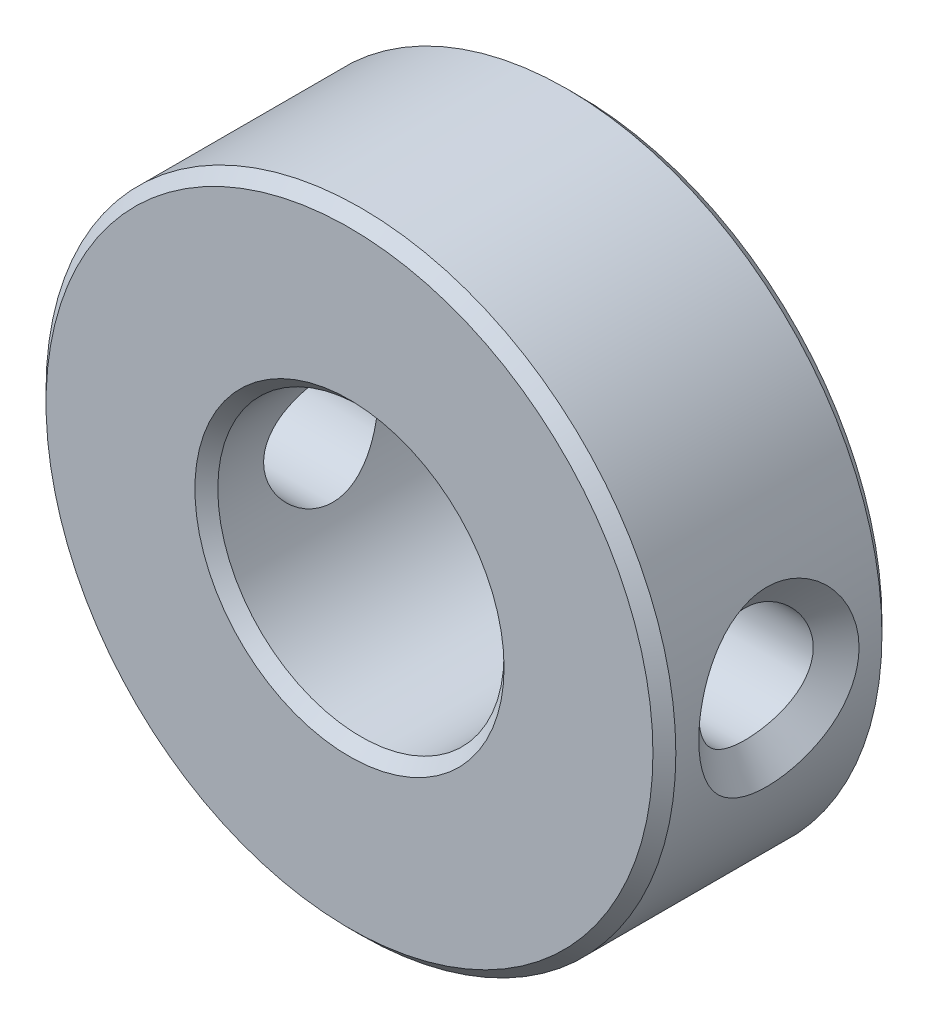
ISO-10303-21;
HEADER;
FILE_DESCRIPTION(('STEP AP214'),'2;1');
FILE_NAME('part.step','',(''),(''),'','','');
FILE_SCHEMA(('AUTOMOTIVE_DESIGN { 1 0 10303 214 1 1 1 1 }'));
ENDSEC;
DATA;
#1=APPLICATION_CONTEXT('core data for automotive mechanical design processes');
#2=APPLICATION_PROTOCOL_DEFINITION('international standard','automotive_design',2000,#1);
#3=PRODUCT_CONTEXT('',#1,'mechanical');
#4=PRODUCT('Part','Part','',(#3));
#5=PRODUCT_RELATED_PRODUCT_CATEGORY('part','',(#4));
#6=PRODUCT_DEFINITION_FORMATION('','',#4);
#7=PRODUCT_DEFINITION_CONTEXT('part definition',#1,'design');
#8=PRODUCT_DEFINITION('design','',#6,#7);
#9=PRODUCT_DEFINITION_SHAPE('','',#8);
#10=(LENGTH_UNIT() NAMED_UNIT(*) SI_UNIT(.MILLI.,.METRE.));
#11=(NAMED_UNIT(*) PLANE_ANGLE_UNIT() SI_UNIT($,.RADIAN.));
#12=(NAMED_UNIT(*) SI_UNIT($,.STERADIAN.) SOLID_ANGLE_UNIT());
#13=UNCERTAINTY_MEASURE_WITH_UNIT(LENGTH_MEASURE(1.E-05),#10,'distance_accuracy_value','');
#14=(GEOMETRIC_REPRESENTATION_CONTEXT(3) GLOBAL_UNCERTAINTY_ASSIGNED_CONTEXT((#13)) GLOBAL_UNIT_ASSIGNED_CONTEXT((#10,
#11,#12)) REPRESENTATION_CONTEXT('',''));
#15=CARTESIAN_POINT('',(0.,0.,0.));
#16=DIRECTION('',(0.,0.,1.));
#17=DIRECTION('',(1.,0.,0.));
#18=AXIS2_PLACEMENT_3D('',#15,#16,#17);
#19=CARTESIAN_POINT('',(0.,0.,10.));
#20=DIRECTION('',(0.,0.,1.));
#21=DIRECTION('',(1.00000000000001,0.,0.));
#22=AXIS2_PLACEMENT_3D('',#19,#20,#21);
#23=PLANE('',#22);
#24=CARTESIAN_POINT('',(0.,0.,10.));
#25=DIRECTION('',(0.,0.,1.));
#26=DIRECTION('',(1.00000000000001,0.,0.));
#27=AXIS2_PLACEMENT_3D('',#24,#25,#26);
#28=CIRCLE('',#27,13.5);
#29=CARTESIAN_POINT('',(13.5000000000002,0.,10.));
#30=VERTEX_POINT('',#29);
#31=EDGE_CURVE('E98',#30,#30,#28,.F.);
#32=ORIENTED_EDGE('',*,*,#31,.T.);
#33=EDGE_LOOP('',(#32));
#34=FACE_BOUND('',#33,.T.);
#35=CARTESIAN_POINT('',(0.,0.,10.));
#36=DIRECTION('',(0.,0.,1.));
#37=DIRECTION('',(1.00000000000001,0.,0.));
#38=AXIS2_PLACEMENT_3D('',#35,#36,#37);
#39=CIRCLE('',#38,26.5);
#40=CARTESIAN_POINT('',(26.5000000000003,0.,9.99999999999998));
#41=VERTEX_POINT('',#40);
#42=EDGE_CURVE('E95',#41,#41,#39,.T.);
#43=ORIENTED_EDGE('',*,*,#42,.T.);
#44=EDGE_LOOP('',(#43));
#45=FACE_BOUND('',#44,.T.);
#46=ADVANCED_FACE('F32',(#34,#45),#23,.T.);
#47=CARTESIAN_POINT('',(0.,0.,-10.));
#48=DIRECTION('',(0.,0.,1.));
#49=DIRECTION('',(1.00000000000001,0.,0.));
#50=AXIS2_PLACEMENT_3D('',#47,#48,#49);
#51=PLANE('',#50);
#52=CARTESIAN_POINT('',(18.1865334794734,-10.4999999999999,-10.));
#53=DIRECTION('',(0.,0.,-1.));
#54=DIRECTION('',(-1.00000000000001,0.,0.));
#55=AXIS2_PLACEMENT_3D('',#52,#53,#54);
#56=CIRCLE('',#55,3.6);
#57=CARTESIAN_POINT('',(14.5865334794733,-10.4999999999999,-10.));
#58=VERTEX_POINT('',#57);
#59=EDGE_CURVE('E71',#58,#58,#56,.T.);
#60=ORIENTED_EDGE('',*,*,#59,.F.);
#61=EDGE_LOOP('',(#60));
#62=FACE_BOUND('',#61,.T.);
#63=CARTESIAN_POINT('',(-18.1865334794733,-10.5000000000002,-10.));
#64=DIRECTION('',(0.,0.,-1.));
#65=DIRECTION('',(-1.00000000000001,0.,0.));
#66=AXIS2_PLACEMENT_3D('',#63,#64,#65);
#67=CIRCLE('',#66,3.6);
#68=CARTESIAN_POINT('',(-21.7865334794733,-10.5000000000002,-10.));
#69=VERTEX_POINT('',#68);
#70=EDGE_CURVE('E64',#69,#69,#67,.T.);
#71=ORIENTED_EDGE('',*,*,#70,.F.);
#72=EDGE_LOOP('',(#71));
#73=FACE_BOUND('',#72,.T.);
#74=CARTESIAN_POINT('',(0.,21.,-10.));
#75=DIRECTION('',(0.,0.,-1.));
#76=DIRECTION('',(-1.00000000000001,0.,0.));
#77=AXIS2_PLACEMENT_3D('',#74,#75,#76);
#78=CIRCLE('',#77,3.6);
#79=CARTESIAN_POINT('',(-3.60000000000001,21.,-10.));
#80=VERTEX_POINT('',#79);
#81=EDGE_CURVE('E80',#80,#80,#78,.T.);
#82=ORIENTED_EDGE('',*,*,#81,.F.);
#83=EDGE_LOOP('',(#82));
#84=FACE_BOUND('',#83,.T.);
#85=CARTESIAN_POINT('',(0.,0.,-10.));
#86=DIRECTION('',(0.,0.,1.));
#87=DIRECTION('',(1.00000000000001,0.,0.));
#88=AXIS2_PLACEMENT_3D('',#85,#86,#87);
#89=CIRCLE('',#88,13.5);
#90=CARTESIAN_POINT('',(13.5000000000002,0.,-10.));
#91=VERTEX_POINT('',#90);
#92=EDGE_CURVE('E110',#91,#91,#89,.T.);
#93=ORIENTED_EDGE('',*,*,#92,.T.);
#94=EDGE_LOOP('',(#93));
#95=FACE_BOUND('',#94,.T.);
#96=CARTESIAN_POINT('',(0.,0.,-10.));
#97=DIRECTION('',(0.,0.,1.));
#98=DIRECTION('',(1.00000000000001,0.,0.));
#99=AXIS2_PLACEMENT_3D('',#96,#97,#98);
#100=CIRCLE('',#99,26.5);
#101=CARTESIAN_POINT('',(26.5000000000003,1.43329792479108E-13,-10.));
#102=VERTEX_POINT('',#101);
#103=EDGE_CURVE('E107',#102,#102,#100,.F.);
#104=ORIENTED_EDGE('',*,*,#103,.T.);
#105=EDGE_LOOP('',(#104));
#106=FACE_BOUND('',#105,.T.);
#107=ADVANCED_FACE('F192',(#62,#73,#84,#95,#106),#51,.F.);
#108=CARTESIAN_POINT('',(0.,0.,10.));
#109=DIRECTION('',(0.,0.,-1.));
#110=DIRECTION('',(-1.00000000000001,0.,0.));
#111=AXIS2_PLACEMENT_3D('',#108,#109,#110);
#112=CYLINDRICAL_SURFACE('',#111,27.5);
#113=CARTESIAN_POINT('',(27.5000000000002,0.,-6.99999988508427));
#114=CARTESIAN_POINT('',(27.5000204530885,0.124339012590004,-7.00008199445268));
#115=CARTESIAN_POINT('',(27.4990934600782,0.248675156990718,-6.99719397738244));
#116=CARTESIAN_POINT('',(27.4954389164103,0.496783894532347,-6.98557095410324));
#117=CARTESIAN_POINT('',(27.4927151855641,0.620557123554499,-6.97684835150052));
#118=CARTESIAN_POINT('',(27.4855674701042,0.867281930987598,-6.95367064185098));
#119=CARTESIAN_POINT('',(27.4811466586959,0.990234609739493,-6.939226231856));
#120=CARTESIAN_POINT('',(27.4707056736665,1.23506392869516,-6.90472069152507));
#121=CARTESIAN_POINT('',(27.4646882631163,1.35694205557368,-6.88466926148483));
#122=CARTESIAN_POINT('',(27.4511545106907,1.59936696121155,-6.8390641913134));
#123=CARTESIAN_POINT('',(27.4436407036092,1.71991563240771,-6.81351985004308));
#124=CARTESIAN_POINT('',(27.4272144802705,1.95942652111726,-6.75704303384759));
#125=CARTESIAN_POINT('',(27.4183045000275,2.07839111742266,-6.72611993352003));
#126=CARTESIAN_POINT('',(27.3991861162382,2.31447857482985,-6.65899916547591));
#127=CARTESIAN_POINT('',(27.388980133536,2.43160442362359,-6.6228113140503));
#128=CARTESIAN_POINT('',(27.3673698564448,2.66375897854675,-6.54527426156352));
#129=CARTESIAN_POINT('',(27.3559680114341,2.77879142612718,-6.50393557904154));
#130=CARTESIAN_POINT('',(27.3320660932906,3.00650360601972,-6.41620982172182));
#131=CARTESIAN_POINT('',(27.3195685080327,3.11918798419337,-6.36983412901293));
#132=CARTESIAN_POINT('',(27.2935751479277,3.34194828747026,-6.27214715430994));
#133=CARTESIAN_POINT('',(27.2800818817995,3.45202990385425,-6.22084818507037));
#134=CARTESIAN_POINT('',(27.2521973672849,3.66932881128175,-6.11342737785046));
#135=CARTESIAN_POINT('',(27.2378086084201,3.77655295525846,-6.0573187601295));
#136=CARTESIAN_POINT('',(27.2082328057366,3.9878808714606,-5.94039145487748));
#137=CARTESIAN_POINT('',(27.1930481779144,4.09199273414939,-5.87958678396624));
#138=CARTESIAN_POINT('',(27.1619824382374,4.29684016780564,-5.75338006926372));
#139=CARTESIAN_POINT('',(27.146103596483,4.39758508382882,-5.68799264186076));
#140=CARTESIAN_POINT('',(27.1137436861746,4.59544194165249,-5.55273408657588));
#141=CARTESIAN_POINT('',(27.0972646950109,4.69256442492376,-5.48287789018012));
#142=CARTESIAN_POINT('',(27.0638270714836,4.88292258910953,-5.33879284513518));
#143=CARTESIAN_POINT('',(27.0468701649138,4.97616983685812,-5.26457888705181));
#144=CARTESIAN_POINT('',(27.0124943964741,5.15851353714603,-5.11190051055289));
#145=CARTESIAN_POINT('',(26.9950771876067,5.24762232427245,-5.0334504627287));
#146=CARTESIAN_POINT('',(26.9601971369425,5.42142032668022,-4.87242280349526));
#147=CARTESIAN_POINT('',(26.9427346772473,5.50612412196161,-4.78986085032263));
#148=CARTESIAN_POINT('',(26.9081931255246,5.67096794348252,-4.62085617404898));
#149=CARTESIAN_POINT('',(26.891112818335,5.75112425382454,-4.53442958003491));
#150=CARTESIAN_POINT('',(26.857364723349,5.90673986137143,-4.35794492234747));
#151=CARTESIAN_POINT('',(26.8406956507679,5.98221532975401,-4.26790136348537));
#152=CARTESIAN_POINT('',(26.8079032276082,6.12834606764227,-4.08442096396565));
#153=CARTESIAN_POINT('',(26.7917781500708,6.19901749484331,-3.9909973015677));
#154=CARTESIAN_POINT('',(26.7601791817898,6.33541408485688,-3.80099750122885));
#155=CARTESIAN_POINT('',(26.7447032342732,6.40115548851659,-3.70443336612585));
#156=CARTESIAN_POINT('',(26.7145153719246,6.52756659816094,-3.5083925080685));
#157=CARTESIAN_POINT('',(26.6998010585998,6.58825264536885,-3.40892669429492));
#158=CARTESIAN_POINT('',(26.6712473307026,6.70442739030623,-3.20732249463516));
#159=CARTESIAN_POINT('',(26.6574052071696,6.75993246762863,-3.10519393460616));
#160=CARTESIAN_POINT('',(26.6307072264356,6.86561973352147,-2.89850419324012));
#161=CARTESIAN_POINT('',(26.6178483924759,6.91581817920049,-2.79395171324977));
#162=CARTESIAN_POINT('',(26.5932281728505,7.01076679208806,-2.58265413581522));
#163=CARTESIAN_POINT('',(26.5814636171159,7.05553281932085,-2.47591653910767));
#164=CARTESIAN_POINT('',(26.5591430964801,7.13949148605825,-2.26048879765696));
#165=CARTESIAN_POINT('',(26.5485838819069,7.17869918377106,-2.15180486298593));
#166=CARTESIAN_POINT('',(26.5287850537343,7.25141650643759,-1.93272459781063));
#167=CARTESIAN_POINT('',(26.5195422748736,7.28493983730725,-1.82233310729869));
#168=CARTESIAN_POINT('',(26.502487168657,7.3461642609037,-1.60007794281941));
#169=CARTESIAN_POINT('',(26.4946719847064,7.37387699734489,-1.48821769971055));
#170=CARTESIAN_POINT('',(26.4805826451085,7.42335695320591,-1.26326528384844));
#171=CARTESIAN_POINT('',(26.4743062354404,7.44513287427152,-1.15017516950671));
#172=CARTESIAN_POINT('',(26.4634048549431,7.48261621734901,-0.923003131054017));
#173=CARTESIAN_POINT('',(26.4587786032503,7.49832834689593,-0.808922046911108));
#174=CARTESIAN_POINT('',(26.4512870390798,7.52356443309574,-0.580008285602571));
#175=CARTESIAN_POINT('',(26.4484218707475,7.53308788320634,-0.465175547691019));
#176=CARTESIAN_POINT('',(26.4445634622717,7.54581982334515,-0.2349973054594));
#177=CARTESIAN_POINT('',(26.4435723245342,7.54902122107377,-0.119651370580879));
#178=CARTESIAN_POINT('',(26.4435651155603,7.54901485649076,0.111038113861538));
#179=CARTESIAN_POINT('',(26.4445490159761,7.54580718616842,0.226381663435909));
#180=CARTESIAN_POINT('',(26.448382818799,7.53310770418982,0.456553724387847));
#181=CARTESIAN_POINT('',(26.4512305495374,7.52362320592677,0.57138267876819));
#182=CARTESIAN_POINT('',(26.4586813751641,7.49849303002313,0.800289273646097));
#183=CARTESIAN_POINT('',(26.4632842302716,7.48284819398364,0.91436701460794));
#184=CARTESIAN_POINT('',(26.4741333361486,7.44552711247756,1.1415348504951));
#185=CARTESIAN_POINT('',(26.480380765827,7.42384653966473,1.25462417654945));
#186=CARTESIAN_POINT('',(26.4944080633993,7.37458023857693,1.47957950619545));
#187=CARTESIAN_POINT('',(26.5021900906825,7.34698618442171,1.59144354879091));
#188=CARTESIAN_POINT('',(26.519175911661,7.28601860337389,1.81371283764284));
#189=CARTESIAN_POINT('',(26.5283824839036,7.25263376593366,1.9241147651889));
#190=CARTESIAN_POINT('',(26.5481071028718,7.18020914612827,2.14322447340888));
#191=CARTESIAN_POINT('',(26.5586282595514,7.1411559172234,2.2519275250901));
#192=CARTESIAN_POINT('',(26.5808720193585,7.05751825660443,2.46740413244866));
#193=CARTESIAN_POINT('',(26.5925978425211,7.0129189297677,2.57417156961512));
#194=CARTESIAN_POINT('',(26.6171411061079,6.91831213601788,2.7855415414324));
#195=CARTESIAN_POINT('',(26.6299617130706,6.86828886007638,2.89013662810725));
#196=CARTESIAN_POINT('',(26.6565849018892,6.76295672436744,3.09692640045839));
#197=CARTESIAN_POINT('',(26.6703904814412,6.70763153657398,3.19911237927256));
#198=CARTESIAN_POINT('',(26.6988739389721,6.59181773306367,3.40084835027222));
#199=CARTESIAN_POINT('',(26.7135545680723,6.53131253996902,3.50038843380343));
#200=CARTESIAN_POINT('',(26.7436790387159,6.40526070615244,3.69659693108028));
#201=CARTESIAN_POINT('',(26.7591253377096,6.33969739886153,3.79325425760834));
#202=CARTESIAN_POINT('',(26.7906701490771,6.20365086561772,3.98346161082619));
#203=CARTESIAN_POINT('',(26.8067707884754,6.13315094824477,4.07699934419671));
#204=CARTESIAN_POINT('',(26.8395206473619,5.98735379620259,4.26073157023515));
#205=CARTESIAN_POINT('',(26.8561716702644,5.91203983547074,4.35091246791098));
#206=CARTESIAN_POINT('',(26.88989113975,5.75673297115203,4.52769641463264));
#207=CARTESIAN_POINT('',(26.9069609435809,5.67672321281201,4.61428439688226));
#208=CARTESIAN_POINT('',(26.9414902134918,5.51215913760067,4.7836434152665));
#209=CARTESIAN_POINT('',(26.9589509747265,5.42758777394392,4.86639762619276));
#210=CARTESIAN_POINT('',(26.9938353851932,5.25402948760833,5.02781727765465));
#211=CARTESIAN_POINT('',(27.011258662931,5.1650274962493,5.10646659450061));
#212=CARTESIAN_POINT('',(27.0456516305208,4.98286635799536,5.25952507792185));
#213=CARTESIAN_POINT('',(27.0626196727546,4.88969470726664,5.33391972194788));
#214=CARTESIAN_POINT('',(27.0960842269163,4.69946427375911,5.478353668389));
#215=CARTESIAN_POINT('',(27.1125790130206,4.60239376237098,5.54837791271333));
#216=CARTESIAN_POINT('',(27.1449746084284,4.40461927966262,5.68395979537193));
#217=CARTESIAN_POINT('',(27.1608733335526,4.3039046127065,5.7495023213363));
#218=CARTESIAN_POINT('',(27.1919824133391,4.09909950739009,5.87600782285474));
#219=CARTESIAN_POINT('',(27.2071904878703,3.99499959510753,5.9369560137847));
#220=CARTESIAN_POINT('',(27.236816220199,3.78368038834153,6.0541598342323));
#221=CARTESIAN_POINT('',(27.2512314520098,3.67645290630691,6.11040130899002));
#222=CARTESIAN_POINT('',(27.2791714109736,3.45913521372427,6.21807829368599));
#223=CARTESIAN_POINT('',(27.2926936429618,3.34903808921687,6.26950049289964));
#224=CARTESIAN_POINT('',(27.3187468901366,3.12623771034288,6.36742532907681));
#225=CARTESIAN_POINT('',(27.331275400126,3.01352874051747,6.41391562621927));
#226=CARTESIAN_POINT('',(27.3552405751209,2.78576137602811,6.50186292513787));
#227=CARTESIAN_POINT('',(27.3666747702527,2.67069834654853,6.54330859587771));
#228=CARTESIAN_POINT('',(27.3883506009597,2.43847968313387,6.62105287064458));
#229=CARTESIAN_POINT('',(27.3985898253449,2.32132035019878,6.65734109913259));
#230=CARTESIAN_POINT('',(27.4177749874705,2.0851660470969,6.72465676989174));
#231=CARTESIAN_POINT('',(27.4267185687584,1.96616815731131,6.7556746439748));
#232=CARTESIAN_POINT('',(27.4432117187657,1.72659385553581,6.81233603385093));
#233=CARTESIAN_POINT('',(27.4507589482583,1.6060151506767,6.83797054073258));
#234=CARTESIAN_POINT('',(27.464358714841,1.36353649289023,6.88375187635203));
#235=CARTESIAN_POINT('',(27.470408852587,1.2416347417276,6.90388990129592));
#236=CARTESIAN_POINT('',(27.480913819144,0.996767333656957,6.93856529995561));
#237=CARTESIAN_POINT('',(27.4853660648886,0.873800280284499,6.9530936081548));
#238=CARTESIAN_POINT('',(27.4925748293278,0.627059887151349,6.97643711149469));
#239=CARTESIAN_POINT('',(27.4953284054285,0.503285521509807,6.98524239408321));
#240=CARTESIAN_POINT('',(27.4990393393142,0.25518739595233,6.99702782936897));
#241=CARTESIAN_POINT('',(27.4999931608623,0.130863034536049,6.99999651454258));
#242=CARTESIAN_POINT('',(27.5000052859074,-0.117815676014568,6.99999800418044));
#243=CARTESIAN_POINT('',(27.4990631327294,-0.24217002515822,6.9970293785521));
#244=CARTESIAN_POINT('',(27.495377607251,-0.490383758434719,6.98524871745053));
#245=CARTESIAN_POINT('',(27.4926369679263,-0.614243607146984,6.97644554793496));
#246=CARTESIAN_POINT('',(27.4854554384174,-0.86120391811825,6.95311165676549));
#247=CARTESIAN_POINT('',(27.481016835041,-0.984305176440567,6.93858863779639));
#248=CARTESIAN_POINT('',(27.4705402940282,-1.22948322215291,6.90393013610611));
#249=CARTESIAN_POINT('',(27.4645044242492,-1.35156112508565,6.88380190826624));
#250=CARTESIAN_POINT('',(27.4509339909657,-1.59442754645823,6.83804735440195));
#251=CARTESIAN_POINT('',(27.4434014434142,-1.71521757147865,6.81242842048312));
#252=CARTESIAN_POINT('',(27.4269381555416,-1.95524316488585,6.75580625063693));
#253=CARTESIAN_POINT('',(27.4180094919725,-2.07448076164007,6.72481100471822));
#254=CARTESIAN_POINT('',(27.3988543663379,-2.31113628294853,6.65754955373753));
#255=CARTESIAN_POINT('',(27.3886301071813,-2.42855692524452,6.62129228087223));
#256=CARTESIAN_POINT('',(27.3669841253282,-2.66131312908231,6.54361978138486));
#257=CARTESIAN_POINT('',(27.3555647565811,-2.77665228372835,6.50221466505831));
#258=CARTESIAN_POINT('',(27.3316288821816,-3.00497990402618,6.41435925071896));
#259=CARTESIAN_POINT('',(27.3191148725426,-3.11797302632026,6.36792037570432));
#260=CARTESIAN_POINT('',(27.2930900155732,-3.34134276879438,6.2701100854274));
#261=CARTESIAN_POINT('',(27.2795817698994,-3.45172528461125,6.21875144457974));
#262=CARTESIAN_POINT('',(27.2516689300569,-3.66960783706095,6.11121421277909));
#263=CARTESIAN_POINT('',(27.2372669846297,-3.77711515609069,6.05504969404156));
#264=CARTESIAN_POINT('',(27.2076667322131,-3.98898111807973,5.93801338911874));
#265=CARTESIAN_POINT('',(27.1924710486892,-4.09334853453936,5.87715682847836));
#266=CARTESIAN_POINT('',(27.161385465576,-4.29866864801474,5.75084910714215));
#267=CARTESIAN_POINT('',(27.1454980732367,-4.39963165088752,5.6854140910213));
#268=CARTESIAN_POINT('',(27.1131235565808,-4.59787590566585,5.55006293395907));
#269=CARTESIAN_POINT('',(27.0966387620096,-4.6951689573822,5.48016352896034));
#270=CARTESIAN_POINT('',(27.0631927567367,-4.88580986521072,5.33599524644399));
#271=CARTESIAN_POINT('',(27.0462335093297,-4.97917085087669,5.261743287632));
#272=CARTESIAN_POINT('',(27.0118552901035,-5.16167123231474,5.10898992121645));
#273=CARTESIAN_POINT('',(26.9944382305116,-5.25082484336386,5.03050508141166));
#274=CARTESIAN_POINT('',(26.9595623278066,-5.4246575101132,4.86940064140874));
#275=CARTESIAN_POINT('',(26.9421039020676,-5.50935243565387,4.78679807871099));
#276=CARTESIAN_POINT('',(26.9075752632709,-5.67415369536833,4.61770282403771));
#277=CARTESIAN_POINT('',(26.8905037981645,-5.75427669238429,4.53122662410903));
#278=CARTESIAN_POINT('',(26.8567763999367,-5.90980260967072,4.35463440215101));
#279=CARTESIAN_POINT('',(26.8401191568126,-5.98522198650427,4.26453312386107));
#280=CARTESIAN_POINT('',(26.8073531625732,-6.13122204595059,4.0809326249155));
#281=CARTESIAN_POINT('',(26.7912426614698,-6.20181908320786,3.98744672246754));
#282=CARTESIAN_POINT('',(26.7596749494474,-6.33805219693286,3.79732071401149));
#283=CARTESIAN_POINT('',(26.7442156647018,-6.40370464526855,3.70069268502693));
#284=CARTESIAN_POINT('',(26.7140626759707,-6.52992712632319,3.50452540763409));
#285=CARTESIAN_POINT('',(26.6993665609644,-6.59051358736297,3.40499710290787));
#286=CARTESIAN_POINT('',(26.6708501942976,-6.70648234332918,3.20327230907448));
#287=CARTESIAN_POINT('',(26.6570272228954,-6.76188108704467,3.10108566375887));
#288=CARTESIAN_POINT('',(26.6303679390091,-6.86735275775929,2.89428715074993));
#289=CARTESIAN_POINT('',(26.6175286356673,-6.91744202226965,2.78968400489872));
#290=CARTESIAN_POINT('',(26.5929473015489,-7.01217319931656,2.57829548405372));
#291=CARTESIAN_POINT('',(26.5812020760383,-7.05683109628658,2.47151764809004));
#292=CARTESIAN_POINT('',(26.5589194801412,-7.14057825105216,2.25602279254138));
#293=CARTESIAN_POINT('',(26.5483788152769,-7.17968277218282,2.14731204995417));
#294=CARTESIAN_POINT('',(26.5286158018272,-7.25220227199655,1.92819449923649));
#295=CARTESIAN_POINT('',(26.5193902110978,-7.28563128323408,1.81779263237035));
#296=CARTESIAN_POINT('',(26.5023676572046,-7.34667934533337,1.59553600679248));
#297=CARTESIAN_POINT('',(26.4945677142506,-7.3743105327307,1.48368481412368));
#298=CARTESIAN_POINT('',(26.4805065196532,-7.42364334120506,1.25877275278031));
#299=CARTESIAN_POINT('',(26.4742428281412,-7.44535437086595,1.14571410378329));
#300=CARTESIAN_POINT('',(26.4633640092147,-7.48272761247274,0.918630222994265));
#301=CARTESIAN_POINT('',(26.4587473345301,-7.49839550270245,0.80460600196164));
#302=CARTESIAN_POINT('',(26.4512716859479,-7.52356607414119,0.575834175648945));
#303=CARTESIAN_POINT('',(26.4484124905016,-7.53306953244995,0.461086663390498));
#304=CARTESIAN_POINT('',(26.4445618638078,-7.54578917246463,0.231110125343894));
#305=CARTESIAN_POINT('',(26.443572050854,-7.54899990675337,0.115880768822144));
#306=CARTESIAN_POINT('',(26.443564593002,-7.54903895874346,-0.114560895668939));
#307=CARTESIAN_POINT('',(26.4445466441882,-7.54586825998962,-0.229773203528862));
#308=CARTESIAN_POINT('',(26.4483752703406,-7.53326230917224,-0.459686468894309));
#309=CARTESIAN_POINT('',(26.4512196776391,-7.52383434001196,-0.574387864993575));
#310=CARTESIAN_POINT('',(26.4586622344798,-7.49883322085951,-0.803043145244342));
#311=CARTESIAN_POINT('',(26.4632601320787,-7.48326095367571,-0.916997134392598));
#312=CARTESIAN_POINT('',(26.47409812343,-7.44609598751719,-1.14392135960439));
#313=CARTESIAN_POINT('',(26.4803393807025,-7.4244990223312,-1.25689083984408));
#314=CARTESIAN_POINT('',(26.4943533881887,-7.37540634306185,-1.48161046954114));
#315=CARTESIAN_POINT('',(26.502128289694,-7.34790233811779,-1.59335867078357));
#316=CARTESIAN_POINT('',(26.5190992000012,-7.28711662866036,-1.81540037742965));
#317=CARTESIAN_POINT('',(26.5282979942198,-7.25382358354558,-1.92569056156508));
#318=CARTESIAN_POINT('',(26.5480066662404,-7.18157975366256,-2.14458100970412));
#319=CARTESIAN_POINT('',(26.5585196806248,-7.14261539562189,-2.25317650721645));
#320=CARTESIAN_POINT('',(26.5807470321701,-7.05914813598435,-2.46844238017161));
#321=CARTESIAN_POINT('',(26.5924646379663,-7.01463009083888,-2.57510654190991));
#322=CARTESIAN_POINT('',(26.616991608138,-6.92017399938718,-2.78627450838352));
#323=CARTESIAN_POINT('',(26.6298042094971,-6.87021975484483,-2.89077068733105));
#324=CARTESIAN_POINT('',(26.6564117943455,-6.76500931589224,-3.09736738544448));
#325=CARTESIAN_POINT('',(26.6702098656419,-6.70973624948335,-3.19945891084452));
#326=CARTESIAN_POINT('',(26.6986789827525,-6.59400583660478,-3.40101094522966));
#327=CARTESIAN_POINT('',(26.7133528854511,-6.53353120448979,-3.50046112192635));
#328=CARTESIAN_POINT('',(26.7434648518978,-6.40751514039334,-3.69649500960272));
#329=CARTESIAN_POINT('',(26.7589054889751,-6.3419561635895,-3.7930670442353));
#330=CARTESIAN_POINT('',(26.7904402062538,-6.20588852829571,-3.9831093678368));
#331=CARTESIAN_POINT('',(26.8065365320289,-6.13536212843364,-4.07656657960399));
#332=CARTESIAN_POINT('',(26.8392792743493,-5.98947752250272,-4.26014336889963));
#333=CARTESIAN_POINT('',(26.8559276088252,-5.91410136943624,-4.35024834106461));
#334=CARTESIAN_POINT('',(26.8896435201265,-5.75863209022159,-4.5268873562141));
#335=CARTESIAN_POINT('',(26.9067125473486,-5.67852072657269,-4.61340506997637));
#336=CARTESIAN_POINT('',(26.941242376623,-5.51370741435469,-4.7826271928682));
#337=CARTESIAN_POINT('',(26.9587045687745,-5.42898687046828,-4.86531321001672));
#338=CARTESIAN_POINT('',(26.9935926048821,-5.25510067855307,-5.02660713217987));
#339=CARTESIAN_POINT('',(27.0110180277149,-5.16591868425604,-5.10519750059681));
#340=CARTESIAN_POINT('',(27.0454150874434,-4.98338880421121,-5.25815620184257));
#341=CARTESIAN_POINT('',(27.062384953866,-4.89002762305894,-5.332509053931));
#342=CARTESIAN_POINT('',(27.0958531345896,-4.6994088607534,-5.47687290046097));
#343=CARTESIAN_POINT('',(27.1123496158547,-4.60213892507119,-5.54686799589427));
#344=CARTESIAN_POINT('',(27.1447487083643,-4.40396015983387,-5.68240521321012));
#345=CARTESIAN_POINT('',(27.1606491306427,-4.30304017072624,-5.74793153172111));
#346=CARTESIAN_POINT('',(27.1917618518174,-4.09782166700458,-5.87441709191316));
#347=CARTESIAN_POINT('',(27.2069717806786,-3.99351335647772,-5.93536101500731));
#348=CARTESIAN_POINT('',(27.2366015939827,-3.78177761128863,-6.05256795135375));
#349=CARTESIAN_POINT('',(27.2510189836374,-3.67434179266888,-6.10881644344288));
#350=CARTESIAN_POINT('',(27.2789637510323,-3.45661062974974,-6.21651818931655));
#351=CARTESIAN_POINT('',(27.2924885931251,-3.34630828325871,-6.26795794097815));
#352=CARTESIAN_POINT('',(27.3185476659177,-3.12310364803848,-6.36592770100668));
#353=CARTESIAN_POINT('',(27.3310793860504,-3.01019564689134,-6.41244536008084));
#354=CARTESIAN_POINT('',(27.3550516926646,-2.7820394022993,-6.5004562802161));
#355=CARTESIAN_POINT('',(27.3664898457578,-2.66678660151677,-6.54193838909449));
#356=CARTESIAN_POINT('',(27.3881744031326,-2.43420059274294,-6.619763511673));
#357=CARTESIAN_POINT('',(27.3984184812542,-2.31686382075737,-6.65609652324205));
#358=CARTESIAN_POINT('',(27.4176142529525,-2.08036986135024,-6.72350879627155));
#359=CARTESIAN_POINT('',(27.4265637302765,-1.96120992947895,-6.75457906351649));
#360=CARTESIAN_POINT('',(27.4430696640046,-1.72132983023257,-6.81135134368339));
#361=CARTESIAN_POINT('',(27.450623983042,-1.60060756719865,-6.8370451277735));
#362=CARTESIAN_POINT('',(27.4642389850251,-1.35786307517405,-6.88295014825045));
#363=CARTESIAN_POINT('',(27.4702975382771,-1.23583924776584,-6.90315357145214));
#364=CARTESIAN_POINT('',(27.4808205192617,-0.990752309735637,-6.93796405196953));
#365=CARTESIAN_POINT('',(27.4852827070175,-0.867687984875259,-6.95256324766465));
#366=CARTESIAN_POINT('',(27.4925124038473,-0.620779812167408,-6.97605146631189));
#367=CARTESIAN_POINT('',(27.4952773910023,-0.496935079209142,-6.98493199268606));
#368=CARTESIAN_POINT('',(27.4990130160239,-0.248729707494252,-6.99687137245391));
#369=CARTESIAN_POINT('',(27.4999806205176,-0.124368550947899,-6.99992038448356));
#370=CARTESIAN_POINT('',(27.5000000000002,0.,-6.99999988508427));
#371=B_SPLINE_CURVE_WITH_KNOTS('',3,(#113,#114,#115,#116,#117,#118,#119,#120,#121,#122,#123,
#124,#125,#126,#127,#128,#129,#130,#131,#132,#133,#134,#135,#136,#137,#138,#139,#140,#141,#142,
#143,#144,#145,#146,#147,#148,#149,#150,#151,#152,#153,#154,#155,#156,#157,#158,#159,#160,#161,
#162,#163,#164,#165,#166,#167,#168,#169,#170,#171,#172,#173,#174,#175,#176,#177,#178,#179,#180,
#181,#182,#183,#184,#185,#186,#187,#188,#189,#190,#191,#192,#193,#194,#195,#196,#197,#198,#199,
#200,#201,#202,#203,#204,#205,#206,#207,#208,#209,#210,#211,#212,#213,#214,#215,#216,#217,#218,
#219,#220,#221,#222,#223,#224,#225,#226,#227,#228,#229,#230,#231,#232,#233,#234,#235,#236,#237,
#238,#239,#240,#241,#242,#243,#244,#245,#246,#247,#248,#249,#250,#251,#252,#253,#254,#255,#256,
#257,#258,#259,#260,#261,#262,#263,#264,#265,#266,#267,#268,#269,#270,#271,#272,#273,#274,#275,
#276,#277,#278,#279,#280,#281,#282,#283,#284,#285,#286,#287,#288,#289,#290,#291,#292,#293,#294,
#295,#296,#297,#298,#299,#300,#301,#302,#303,#304,#305,#306,#307,#308,#309,#310,#311,#312,#313,
#314,#315,#316,#317,#318,#319,#320,#321,#322,#323,#324,#325,#326,#327,#328,#329,#330,#331,#332,
#333,#334,#335,#336,#337,#338,#339,#340,#341,#342,#343,#344,#345,#346,#347,#348,#349,#350,#351,
#352,#353,#354,#355,#356,#357,#358,#359,#360,#361,#362,#363,#364,#365,#366,#367,#368,#369,#370),
.UNSPECIFIED.,.F.,.F.,(4,2,2,2,2,2,2,2,2,2,2,2,2,2,2,2,2,2,2,2,2,2,2,2,2,2,2,2,2,2,2,2,2,2,2,2,
2,2,2,2,2,2,2,2,2,2,2,2,2,2,2,2,2,2,2,2,2,2,2,2,2,2,2,2,2,2,2,2,2,2,2,2,2,2,2,2,2,2,2,2,2,2,2,2,
2,2,2,2,2,2,2,2,2,2,2,2,2,2,2,2,2,2,2,2,2,2,2,2,2,2,2,2,2,2,2,2,2,2,2,2,2,2,2,2,2,2,2,2,4),(0.,
0.37297085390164,0.745151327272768,1.11663925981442,1.48748844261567,1.85771469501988,
2.22730203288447,2.59620889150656,2.96437438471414,3.33172459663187,3.69817891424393,
4.06365641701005,4.42808234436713,4.79139466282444,5.15355075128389,5.51453421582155,
5.8743618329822,6.23291077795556,6.59008214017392,6.94594157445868,7.30053794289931,
7.65390956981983,8.00609062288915,8.35711761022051,8.70703598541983,9.05590685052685,
9.4038137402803,9.75086945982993,10.0972229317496,10.4430659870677,10.7886400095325,
11.1342423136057,11.4802321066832,11.8262169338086,12.1717993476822,12.517334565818,
12.8631181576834,13.2093918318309,13.556349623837,13.9041443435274,14.252894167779,
14.602689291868,14.9535985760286,15.305676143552,15.65896790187,16.0135179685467,
16.369374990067,16.7265983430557,17.0852642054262,17.4452466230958,17.8063922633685,
18.1687203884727,18.5322154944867,18.8968343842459,19.2625131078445,19.6291737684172,
19.9967312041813,20.3650995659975,20.7341988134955,21.1039611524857,21.4743374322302,
21.8453035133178,22.2168666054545,22.5890715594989,22.9620070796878,23.3350324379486,
23.7074922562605,24.0794522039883,24.4509329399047,24.8219166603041,25.192353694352,
25.5621691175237,25.9312693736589,26.2995489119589,26.6668968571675,27.0332037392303,
27.3983683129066,27.7623044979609,28.1249484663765,28.4862658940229,28.8462593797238,
29.2048702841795,29.5620775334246,29.9179553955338,30.2725593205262,30.6259321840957,
30.9781106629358,31.3291317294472,31.6790392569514,32.0278907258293,32.3757640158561,
32.722764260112,33.0690307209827,33.4147436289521,33.7601309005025,34.1054746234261,
34.4511171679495,34.7967064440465,35.1418941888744,35.4870323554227,35.8324155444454,
36.1782867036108,36.5248432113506,36.8722432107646,37.2206120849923,37.5700489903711,
37.920633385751,38.272431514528,38.6255028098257,38.9799062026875,39.3357063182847,
39.6929795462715,40.0518199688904,40.4120882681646,40.7735979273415,41.1363573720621,
41.5003394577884,41.8654886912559,42.2317283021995,42.5989671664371,42.967106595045,
43.3360470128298,43.7056945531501,44.075967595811,44.4468032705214,44.8181639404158,
45.1900436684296,45.5624746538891,45.9355336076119),.UNSPECIFIED.);
#372=CARTESIAN_POINT('',(27.5000000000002,0.,-6.99999988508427));
#373=VERTEX_POINT('',#372);
#374=EDGE_CURVE('E271',#373,#373,#371,.F.);
#375=ORIENTED_EDGE('',*,*,#374,.T.);
#376=EDGE_LOOP('',(#375));
#377=FACE_BOUND('',#376,.T.);
#378=CARTESIAN_POINT('',(-27.5000000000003,-1.93421667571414E-13,6.99999988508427));
#379=CARTESIAN_POINT('',(-27.5000204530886,0.124339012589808,7.00008199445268));
#380=CARTESIAN_POINT('',(-27.4990934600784,0.248675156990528,6.99719397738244));
#381=CARTESIAN_POINT('',(-27.4954389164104,0.496783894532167,6.98557095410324));
#382=CARTESIAN_POINT('',(-27.4927151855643,0.620557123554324,6.97684835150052));
#383=CARTESIAN_POINT('',(-27.4855674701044,0.867281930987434,6.95367064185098));
#384=CARTESIAN_POINT('',(-27.4811466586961,0.990234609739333,6.93922623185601));
#385=CARTESIAN_POINT('',(-27.4707056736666,1.23506392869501,6.90472069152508));
#386=CARTESIAN_POINT('',(-27.4646882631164,1.35694205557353,6.88466926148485));
#387=CARTESIAN_POINT('',(-27.4511545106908,1.59936696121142,6.83906419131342));
#388=CARTESIAN_POINT('',(-27.4436407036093,1.71991563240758,6.81351985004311));
#389=CARTESIAN_POINT('',(-27.4272144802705,1.95942652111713,6.75704303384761));
#390=CARTESIAN_POINT('',(-27.4183045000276,2.07839111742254,6.72611993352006));
#391=CARTESIAN_POINT('',(-27.3991861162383,2.31447857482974,6.65899916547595));
#392=CARTESIAN_POINT('',(-27.3889801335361,2.43160442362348,6.62281131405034));
#393=CARTESIAN_POINT('',(-27.3673698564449,2.66375897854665,6.54527426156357));
#394=CARTESIAN_POINT('',(-27.3559680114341,2.77879142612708,6.50393557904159));
#395=CARTESIAN_POINT('',(-27.3320660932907,3.00650360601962,6.41620982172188));
#396=CARTESIAN_POINT('',(-27.3195685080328,3.11918798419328,6.36983412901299));
#397=CARTESIAN_POINT('',(-27.2935751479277,3.34194828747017,6.27214715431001));
#398=CARTESIAN_POINT('',(-27.2800818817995,3.45202990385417,6.22084818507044));
#399=CARTESIAN_POINT('',(-27.2521973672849,3.66932881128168,6.11342737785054));
#400=CARTESIAN_POINT('',(-27.2378086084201,3.77655295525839,6.05731876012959));
#401=CARTESIAN_POINT('',(-27.2082328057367,3.98788087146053,5.94039145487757));
#402=CARTESIAN_POINT('',(-27.1930481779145,4.09199273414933,5.87958678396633));
#403=CARTESIAN_POINT('',(-27.1619824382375,4.29684016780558,5.75338006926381));
#404=CARTESIAN_POINT('',(-27.1461035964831,4.39758508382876,5.68799264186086));
#405=CARTESIAN_POINT('',(-27.1137436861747,4.59544194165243,5.55273408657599));
#406=CARTESIAN_POINT('',(-27.097264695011,4.6925644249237,5.48287789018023));
#407=CARTESIAN_POINT('',(-27.0638270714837,4.88292258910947,5.33879284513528));
#408=CARTESIAN_POINT('',(-27.0468701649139,4.97616983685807,5.26457888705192));
#409=CARTESIAN_POINT('',(-27.0124943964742,5.15851353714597,5.111900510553));
#410=CARTESIAN_POINT('',(-26.9950771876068,5.24762232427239,5.03345046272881));
#411=CARTESIAN_POINT('',(-26.9601971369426,5.42142032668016,4.87242280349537));
#412=CARTESIAN_POINT('',(-26.9427346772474,5.50612412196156,4.78986085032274));
#413=CARTESIAN_POINT('',(-26.9081931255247,5.67096794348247,4.62085617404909));
#414=CARTESIAN_POINT('',(-26.8911128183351,5.75112425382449,4.53442958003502));
#415=CARTESIAN_POINT('',(-26.8573647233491,5.90673986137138,4.35794492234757));
#416=CARTESIAN_POINT('',(-26.840695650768,5.98221532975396,4.26790136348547));
#417=CARTESIAN_POINT('',(-26.8079032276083,6.12834606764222,4.08442096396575));
#418=CARTESIAN_POINT('',(-26.7917781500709,6.19901749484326,3.9909973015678));
#419=CARTESIAN_POINT('',(-26.7601791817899,6.33541408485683,3.80099750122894));
#420=CARTESIAN_POINT('',(-26.7447032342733,6.40115548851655,3.70443336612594));
#421=CARTESIAN_POINT('',(-26.7145153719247,6.5275665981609,3.50839250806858));
#422=CARTESIAN_POINT('',(-26.6998010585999,6.58825264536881,3.408926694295));
#423=CARTESIAN_POINT('',(-26.6712473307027,6.70442739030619,3.20732249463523));
#424=CARTESIAN_POINT('',(-26.6574052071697,6.75993246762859,3.10519393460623));
#425=CARTESIAN_POINT('',(-26.6307072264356,6.86561973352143,2.89850419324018));
#426=CARTESIAN_POINT('',(-26.617848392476,6.91581817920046,2.79395171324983));
#427=CARTESIAN_POINT('',(-26.5932281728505,7.01076679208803,2.58265413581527));
#428=CARTESIAN_POINT('',(-26.581463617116,7.05553281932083,2.47591653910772));
#429=CARTESIAN_POINT('',(-26.5591430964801,7.13949148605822,2.260488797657));
#430=CARTESIAN_POINT('',(-26.548583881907,7.17869918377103,2.15180486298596));
#431=CARTESIAN_POINT('',(-26.5287850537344,7.25141650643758,1.93272459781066));
#432=CARTESIAN_POINT('',(-26.5195422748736,7.28493983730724,1.82233310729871));
#433=CARTESIAN_POINT('',(-26.5024871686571,7.34616426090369,1.60007794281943));
#434=CARTESIAN_POINT('',(-26.4946719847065,7.37387699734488,1.48821769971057));
#435=CARTESIAN_POINT('',(-26.4805826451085,7.4233569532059,1.26326528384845));
#436=CARTESIAN_POINT('',(-26.4743062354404,7.44513287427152,1.15017516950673));
#437=CARTESIAN_POINT('',(-26.4634048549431,7.482616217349,0.923003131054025));
#438=CARTESIAN_POINT('',(-26.4587786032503,7.49832834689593,0.808922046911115));
#439=CARTESIAN_POINT('',(-26.4512870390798,7.52356443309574,0.580008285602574));
#440=CARTESIAN_POINT('',(-26.4484218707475,7.53308788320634,0.465175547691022));
#441=CARTESIAN_POINT('',(-26.4445634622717,7.54581982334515,0.234997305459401));
#442=CARTESIAN_POINT('',(-26.4435723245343,7.54902122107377,0.119651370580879));
#443=CARTESIAN_POINT('',(-26.4435651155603,7.54901485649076,-0.111038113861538));
#444=CARTESIAN_POINT('',(-26.4445490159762,7.54580718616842,-0.226381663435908));
#445=CARTESIAN_POINT('',(-26.4483828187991,7.53310770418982,-0.456553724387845));
#446=CARTESIAN_POINT('',(-26.4512305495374,7.52362320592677,-0.571382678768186));
#447=CARTESIAN_POINT('',(-26.4586813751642,7.49849303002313,-0.800289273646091));
#448=CARTESIAN_POINT('',(-26.4632842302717,7.48284819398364,-0.914367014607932));
#449=CARTESIAN_POINT('',(-26.4741333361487,7.44552711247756,-1.14153485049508));
#450=CARTESIAN_POINT('',(-26.4803807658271,7.42384653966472,-1.25462417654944));
#451=CARTESIAN_POINT('',(-26.4944080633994,7.37458023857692,-1.47957950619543));
#452=CARTESIAN_POINT('',(-26.5021900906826,7.3469861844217,-1.59144354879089));
#453=CARTESIAN_POINT('',(-26.5191759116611,7.28601860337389,-1.81371283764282));
#454=CARTESIAN_POINT('',(-26.5283824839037,7.25263376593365,-1.92411476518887));
#455=CARTESIAN_POINT('',(-26.5481071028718,7.18020914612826,-2.14322447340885));
#456=CARTESIAN_POINT('',(-26.5586282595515,7.14115591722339,-2.25192752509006));
#457=CARTESIAN_POINT('',(-26.5808720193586,7.05751825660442,-2.46740413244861));
#458=CARTESIAN_POINT('',(-26.5925978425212,7.01291892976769,-2.57417156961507));
#459=CARTESIAN_POINT('',(-26.617141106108,6.91831213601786,-2.78554154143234));
#460=CARTESIAN_POINT('',(-26.6299617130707,6.86828886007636,-2.89013662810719));
#461=CARTESIAN_POINT('',(-26.6565849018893,6.76295672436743,-3.09692640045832));
#462=CARTESIAN_POINT('',(-26.6703904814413,6.70763153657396,-3.19911237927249));
#463=CARTESIAN_POINT('',(-26.6988739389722,6.59181773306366,-3.40084835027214));
#464=CARTESIAN_POINT('',(-26.7135545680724,6.531312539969,-3.50038843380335));
#465=CARTESIAN_POINT('',(-26.743679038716,6.40526070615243,-3.69659693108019));
#466=CARTESIAN_POINT('',(-26.7591253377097,6.33969739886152,-3.79325425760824));
#467=CARTESIAN_POINT('',(-26.7906701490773,6.20365086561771,-3.98346161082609));
#468=CARTESIAN_POINT('',(-26.8067707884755,6.13315094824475,-4.07699934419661));
#469=CARTESIAN_POINT('',(-26.839520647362,5.98735379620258,-4.26073157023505));
#470=CARTESIAN_POINT('',(-26.8561716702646,5.91203983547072,-4.35091246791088));
#471=CARTESIAN_POINT('',(-26.8898911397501,5.75673297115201,-4.52769641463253));
#472=CARTESIAN_POINT('',(-26.906960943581,5.676723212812,-4.61428439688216));
#473=CARTESIAN_POINT('',(-26.9414902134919,5.51215913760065,-4.78364341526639));
#474=CARTESIAN_POINT('',(-26.9589509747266,5.42758777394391,-4.86639762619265));
#475=CARTESIAN_POINT('',(-26.9938353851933,5.25402948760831,-5.02781727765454));
#476=CARTESIAN_POINT('',(-27.0112586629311,5.16502749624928,-5.1064665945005));
#477=CARTESIAN_POINT('',(-27.0456516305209,4.98286635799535,-5.25952507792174));
#478=CARTESIAN_POINT('',(-27.0626196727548,4.88969470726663,-5.33391972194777));
#479=CARTESIAN_POINT('',(-27.0960842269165,4.6994642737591,-5.4783536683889));
#480=CARTESIAN_POINT('',(-27.1125790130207,4.60239376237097,-5.54837791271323));
#481=CARTESIAN_POINT('',(-27.1449746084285,4.40461927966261,-5.68395979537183));
#482=CARTESIAN_POINT('',(-27.1608733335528,4.30390461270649,-5.74950232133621));
#483=CARTESIAN_POINT('',(-27.1919824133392,4.09909950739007,-5.87600782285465));
#484=CARTESIAN_POINT('',(-27.2071904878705,3.99499959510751,-5.93695601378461));
#485=CARTESIAN_POINT('',(-27.2368162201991,3.78368038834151,-6.05415983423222));
#486=CARTESIAN_POINT('',(-27.2512314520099,3.67645290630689,-6.11040130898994));
#487=CARTESIAN_POINT('',(-27.2791714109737,3.45913521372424,-6.21807829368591));
#488=CARTESIAN_POINT('',(-27.2926936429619,3.34903808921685,-6.26950049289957));
#489=CARTESIAN_POINT('',(-27.3187468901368,3.12623771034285,-6.36742532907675));
#490=CARTESIAN_POINT('',(-27.3312754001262,3.01352874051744,-6.41391562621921));
#491=CARTESIAN_POINT('',(-27.3552405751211,2.78576137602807,-6.50186292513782));
#492=CARTESIAN_POINT('',(-27.3666747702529,2.67069834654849,-6.54330859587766));
#493=CARTESIAN_POINT('',(-27.3883506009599,2.43847968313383,-6.62105287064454));
#494=CARTESIAN_POINT('',(-27.398589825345,2.32132035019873,-6.65734109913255));
#495=CARTESIAN_POINT('',(-27.4177749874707,2.08516604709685,-6.72465676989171));
#496=CARTESIAN_POINT('',(-27.4267185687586,1.96616815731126,-6.75567464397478));
#497=CARTESIAN_POINT('',(-27.4432117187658,1.72659385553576,-6.81233603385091));
#498=CARTESIAN_POINT('',(-27.4507589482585,1.60601515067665,-6.83797054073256));
#499=CARTESIAN_POINT('',(-27.4643587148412,1.36353649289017,-6.88375187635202));
#500=CARTESIAN_POINT('',(-27.4704088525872,1.24163474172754,-6.90388990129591));
#501=CARTESIAN_POINT('',(-27.4809138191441,0.996767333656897,-6.9385652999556));
#502=CARTESIAN_POINT('',(-27.4853660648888,0.873800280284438,-6.95309360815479));
#503=CARTESIAN_POINT('',(-27.4925748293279,0.627059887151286,-6.97643711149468));
#504=CARTESIAN_POINT('',(-27.4953284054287,0.503285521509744,-6.98524239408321));
#505=CARTESIAN_POINT('',(-27.4990393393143,0.255187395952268,-6.99702782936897));
#506=CARTESIAN_POINT('',(-27.4999931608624,0.130863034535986,-6.99999651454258));
#507=CARTESIAN_POINT('',(-27.5000052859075,-0.11781567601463,-6.99999800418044));
#508=CARTESIAN_POINT('',(-27.4990631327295,-0.242170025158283,-6.9970293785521));
#509=CARTESIAN_POINT('',(-27.4953776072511,-0.490383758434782,-6.98524871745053));
#510=CARTESIAN_POINT('',(-27.4926369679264,-0.614243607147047,-6.97644554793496));
#511=CARTESIAN_POINT('',(-27.4854554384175,-0.861203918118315,-6.9531116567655));
#512=CARTESIAN_POINT('',(-27.4810168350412,-0.984305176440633,-6.93858863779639));
#513=CARTESIAN_POINT('',(-27.4705402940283,-1.22948322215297,-6.90393013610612));
#514=CARTESIAN_POINT('',(-27.4645044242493,-1.35156112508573,-6.88380190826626));
#515=CARTESIAN_POINT('',(-27.4509339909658,-1.5944275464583,-6.83804735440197));
#516=CARTESIAN_POINT('',(-27.4434014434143,-1.71521757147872,-6.81242842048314));
#517=CARTESIAN_POINT('',(-27.4269381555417,-1.95524316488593,-6.75580625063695));
#518=CARTESIAN_POINT('',(-27.4180094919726,-2.07448076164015,-6.72481100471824));
#519=CARTESIAN_POINT('',(-27.398854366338,-2.31113628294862,-6.65754955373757));
#520=CARTESIAN_POINT('',(-27.3886301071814,-2.42855692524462,-6.62129228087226));
#521=CARTESIAN_POINT('',(-27.3669841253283,-2.66131312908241,-6.5436197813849));
#522=CARTESIAN_POINT('',(-27.3555647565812,-2.77665228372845,-6.50221466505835));
#523=CARTESIAN_POINT('',(-27.3316288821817,-3.00497990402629,-6.414359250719));
#524=CARTESIAN_POINT('',(-27.3191148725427,-3.11797302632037,-6.36792037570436));
#525=CARTESIAN_POINT('',(-27.2930900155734,-3.3413427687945,-6.27011008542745));
#526=CARTESIAN_POINT('',(-27.2795817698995,-3.45172528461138,-6.21875144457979));
#527=CARTESIAN_POINT('',(-27.2516689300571,-3.66960783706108,-6.11121421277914));
#528=CARTESIAN_POINT('',(-27.2372669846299,-3.77711515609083,-6.05504969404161));
#529=CARTESIAN_POINT('',(-27.2076667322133,-3.98898111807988,-5.93801338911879));
#530=CARTESIAN_POINT('',(-27.1924710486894,-4.09334853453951,-5.8771568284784));
#531=CARTESIAN_POINT('',(-27.1613854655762,-4.2986686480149,-5.75084910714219));
#532=CARTESIAN_POINT('',(-27.1454980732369,-4.39963165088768,-5.68541409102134));
#533=CARTESIAN_POINT('',(-27.113123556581,-4.59787590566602,-5.55006293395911));
#534=CARTESIAN_POINT('',(-27.0966387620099,-4.69516895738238,-5.48016352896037));
#535=CARTESIAN_POINT('',(-27.063192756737,-4.88580986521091,-5.33599524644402));
#536=CARTESIAN_POINT('',(-27.04623350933,-4.97917085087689,-5.26174328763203));
#537=CARTESIAN_POINT('',(-27.0118552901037,-5.16167123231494,-5.10898992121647));
#538=CARTESIAN_POINT('',(-26.9944382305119,-5.25082484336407,-5.03050508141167));
#539=CARTESIAN_POINT('',(-26.9595623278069,-5.42465751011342,-4.86940064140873));
#540=CARTESIAN_POINT('',(-26.9421039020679,-5.50935243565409,-4.78679807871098));
#541=CARTESIAN_POINT('',(-26.9075752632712,-5.67415369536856,-4.61770282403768));
#542=CARTESIAN_POINT('',(-26.8905037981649,-5.75427669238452,-4.531226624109));
#543=CARTESIAN_POINT('',(-26.856776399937,-5.90980260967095,-4.35463440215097));
#544=CARTESIAN_POINT('',(-26.8401191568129,-5.9852219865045,-4.26453312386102));
#545=CARTESIAN_POINT('',(-26.8073531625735,-6.13122204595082,-4.08093262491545));
#546=CARTESIAN_POINT('',(-26.7912426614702,-6.20181908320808,-3.98744672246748));
#547=CARTESIAN_POINT('',(-26.7596749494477,-6.33805219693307,-3.79732071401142));
#548=CARTESIAN_POINT('',(-26.7442156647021,-6.40370464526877,-3.70069268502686));
#549=CARTESIAN_POINT('',(-26.714062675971,-6.5299271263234,-3.50452540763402));
#550=CARTESIAN_POINT('',(-26.6993665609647,-6.59051358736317,-3.40499710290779));
#551=CARTESIAN_POINT('',(-26.6708501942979,-6.70648234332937,-3.2032723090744));
#552=CARTESIAN_POINT('',(-26.6570272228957,-6.76188108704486,-3.10108566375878));
#553=CARTESIAN_POINT('',(-26.6303679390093,-6.86735275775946,-2.89428715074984));
#554=CARTESIAN_POINT('',(-26.6175286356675,-6.91744202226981,-2.78968400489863));
#555=CARTESIAN_POINT('',(-26.5929473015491,-7.01217319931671,-2.57829548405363));
#556=CARTESIAN_POINT('',(-26.5812020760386,-7.05683109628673,-2.47151764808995));
#557=CARTESIAN_POINT('',(-26.5589194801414,-7.1405782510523,-2.25602279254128));
#558=CARTESIAN_POINT('',(-26.5483788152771,-7.17968277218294,-2.14731204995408));
#559=CARTESIAN_POINT('',(-26.5286158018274,-7.25220227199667,-1.9281944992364));
#560=CARTESIAN_POINT('',(-26.519390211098,-7.2856312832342,-1.81779263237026));
#561=CARTESIAN_POINT('',(-26.5023676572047,-7.34667934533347,-1.59553600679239));
#562=CARTESIAN_POINT('',(-26.4945677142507,-7.37431053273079,-1.48368481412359));
#563=CARTESIAN_POINT('',(-26.4805065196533,-7.42364334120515,-1.25877275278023));
#564=CARTESIAN_POINT('',(-26.4742428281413,-7.44535437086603,-1.14571410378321));
#565=CARTESIAN_POINT('',(-26.4633640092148,-7.48272761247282,-0.918630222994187));
#566=CARTESIAN_POINT('',(-26.4587473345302,-7.49839550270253,-0.804606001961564));
#567=CARTESIAN_POINT('',(-26.451271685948,-7.52356607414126,-0.575834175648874));
#568=CARTESIAN_POINT('',(-26.4484124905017,-7.53306953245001,-0.46108666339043));
#569=CARTESIAN_POINT('',(-26.4445618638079,-7.54578917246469,-0.231110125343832));
#570=CARTESIAN_POINT('',(-26.4435720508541,-7.54899990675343,-0.115880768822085));
#571=CARTESIAN_POINT('',(-26.4435645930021,-7.54903895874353,0.114560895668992));
#572=CARTESIAN_POINT('',(-26.4445466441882,-7.54586825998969,0.229773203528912));
#573=CARTESIAN_POINT('',(-26.4483752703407,-7.53326230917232,0.459686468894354));
#574=CARTESIAN_POINT('',(-26.4512196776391,-7.52383434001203,0.574387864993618));
#575=CARTESIAN_POINT('',(-26.4586622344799,-7.49883322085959,0.803043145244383));
#576=CARTESIAN_POINT('',(-26.4632601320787,-7.48326095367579,0.916997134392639));
#577=CARTESIAN_POINT('',(-26.47409812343,-7.44609598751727,1.14392135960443));
#578=CARTESIAN_POINT('',(-26.4803393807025,-7.42449902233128,1.25689083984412));
#579=CARTESIAN_POINT('',(-26.4943533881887,-7.37540634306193,1.48161046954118));
#580=CARTESIAN_POINT('',(-26.5021282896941,-7.34790233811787,1.59335867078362));
#581=CARTESIAN_POINT('',(-26.5190992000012,-7.28711662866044,1.8154003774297));
#582=CARTESIAN_POINT('',(-26.5282979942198,-7.25382358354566,1.92569056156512));
#583=CARTESIAN_POINT('',(-26.5480066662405,-7.18157975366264,2.14458100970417));
#584=CARTESIAN_POINT('',(-26.5585196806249,-7.14261539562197,2.2531765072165));
#585=CARTESIAN_POINT('',(-26.5807470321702,-7.05914813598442,2.46844238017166));
#586=CARTESIAN_POINT('',(-26.5924646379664,-7.01463009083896,2.57510654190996));
#587=CARTESIAN_POINT('',(-26.6169916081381,-6.92017399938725,2.78627450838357));
#588=CARTESIAN_POINT('',(-26.6298042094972,-6.8702197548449,2.89077068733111));
#589=CARTESIAN_POINT('',(-26.6564117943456,-6.76500931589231,3.09736738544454));
#590=CARTESIAN_POINT('',(-26.670209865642,-6.70973624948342,3.19945891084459));
#591=CARTESIAN_POINT('',(-26.6986789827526,-6.59400583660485,3.40101094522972));
#592=CARTESIAN_POINT('',(-26.7133528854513,-6.53353120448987,3.50046112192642));
#593=CARTESIAN_POINT('',(-26.7434648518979,-6.40751514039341,3.69649500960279));
#594=CARTESIAN_POINT('',(-26.7589054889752,-6.34195616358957,3.79306704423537));
#595=CARTESIAN_POINT('',(-26.7904402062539,-6.20588852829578,3.98310936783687));
#596=CARTESIAN_POINT('',(-26.806536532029,-6.13536212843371,4.07656657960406));
#597=CARTESIAN_POINT('',(-26.8392792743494,-5.98947752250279,4.2601433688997));
#598=CARTESIAN_POINT('',(-26.8559276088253,-5.91410136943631,4.35024834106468));
#599=CARTESIAN_POINT('',(-26.8896435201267,-5.75863209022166,4.52688735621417));
#600=CARTESIAN_POINT('',(-26.9067125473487,-5.67852072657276,4.61340506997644));
#601=CARTESIAN_POINT('',(-26.9412423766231,-5.51370741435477,4.78262719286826));
#602=CARTESIAN_POINT('',(-26.9587045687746,-5.42898687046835,4.86531321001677));
#603=CARTESIAN_POINT('',(-26.9935926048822,-5.25510067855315,5.02660713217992));
#604=CARTESIAN_POINT('',(-27.011018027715,-5.16591868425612,5.10519750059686));
#605=CARTESIAN_POINT('',(-27.0454150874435,-4.98338880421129,5.25815620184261));
#606=CARTESIAN_POINT('',(-27.0623849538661,-4.89002762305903,5.33250905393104));
#607=CARTESIAN_POINT('',(-27.0958531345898,-4.6994088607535,5.476872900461));
#608=CARTESIAN_POINT('',(-27.1123496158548,-4.60213892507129,5.5468679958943));
#609=CARTESIAN_POINT('',(-27.1447487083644,-4.40396015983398,5.68240521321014));
#610=CARTESIAN_POINT('',(-27.1606491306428,-4.30304017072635,5.74793153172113));
#611=CARTESIAN_POINT('',(-27.1917618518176,-4.0978216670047,5.87441709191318));
#612=CARTESIAN_POINT('',(-27.2069717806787,-3.99351335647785,5.93536101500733));
#613=CARTESIAN_POINT('',(-27.2366015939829,-3.78177761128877,6.05256795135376));
#614=CARTESIAN_POINT('',(-27.2510189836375,-3.67434179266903,6.10881644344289));
#615=CARTESIAN_POINT('',(-27.2789637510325,-3.45661062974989,6.21651818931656));
#616=CARTESIAN_POINT('',(-27.2924885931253,-3.34630828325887,6.26795794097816));
#617=CARTESIAN_POINT('',(-27.3185476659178,-3.12310364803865,6.36592770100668));
#618=CARTESIAN_POINT('',(-27.3310793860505,-3.01019564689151,6.41244536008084));
#619=CARTESIAN_POINT('',(-27.3550516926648,-2.78203940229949,6.50045628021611));
#620=CARTESIAN_POINT('',(-27.3664898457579,-2.66678660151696,6.54193838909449));
#621=CARTESIAN_POINT('',(-27.3881744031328,-2.43420059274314,6.619763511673));
#622=CARTESIAN_POINT('',(-27.3984184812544,-2.31686382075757,6.65609652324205));
#623=CARTESIAN_POINT('',(-27.4176142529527,-2.08036986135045,6.72350879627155));
#624=CARTESIAN_POINT('',(-27.4265637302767,-1.96120992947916,6.75457906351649));
#625=CARTESIAN_POINT('',(-27.4430696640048,-1.72132983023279,6.81135134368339));
#626=CARTESIAN_POINT('',(-27.4506239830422,-1.60060756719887,6.8370451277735));
#627=CARTESIAN_POINT('',(-27.4642389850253,-1.35786307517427,6.88295014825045));
#628=CARTESIAN_POINT('',(-27.4702975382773,-1.23583924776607,6.90315357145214));
#629=CARTESIAN_POINT('',(-27.4808205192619,-0.990752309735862,6.93796405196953));
#630=CARTESIAN_POINT('',(-27.4852827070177,-0.867687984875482,6.95256324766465));
#631=CARTESIAN_POINT('',(-27.4925124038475,-0.620779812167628,6.97605146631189));
#632=CARTESIAN_POINT('',(-27.4952773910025,-0.496935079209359,6.98493199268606));
#633=CARTESIAN_POINT('',(-27.4990130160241,-0.248729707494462,6.99687137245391));
#634=CARTESIAN_POINT('',(-27.4999806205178,-0.124368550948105,6.99992038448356));
#635=CARTESIAN_POINT('',(-27.5000000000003,-1.93421667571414E-13,6.99999988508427));
#636=B_SPLINE_CURVE_WITH_KNOTS('',3,(#378,#379,#380,#381,#382,#383,#384,#385,#386,#387,#388,
#389,#390,#391,#392,#393,#394,#395,#396,#397,#398,#399,#400,#401,#402,#403,#404,#405,#406,#407,
#408,#409,#410,#411,#412,#413,#414,#415,#416,#417,#418,#419,#420,#421,#422,#423,#424,#425,#426,
#427,#428,#429,#430,#431,#432,#433,#434,#435,#436,#437,#438,#439,#440,#441,#442,#443,#444,#445,
#446,#447,#448,#449,#450,#451,#452,#453,#454,#455,#456,#457,#458,#459,#460,#461,#462,#463,#464,
#465,#466,#467,#468,#469,#470,#471,#472,#473,#474,#475,#476,#477,#478,#479,#480,#481,#482,#483,
#484,#485,#486,#487,#488,#489,#490,#491,#492,#493,#494,#495,#496,#497,#498,#499,#500,#501,#502,
#503,#504,#505,#506,#507,#508,#509,#510,#511,#512,#513,#514,#515,#516,#517,#518,#519,#520,#521,
#522,#523,#524,#525,#526,#527,#528,#529,#530,#531,#532,#533,#534,#535,#536,#537,#538,#539,#540,
#541,#542,#543,#544,#545,#546,#547,#548,#549,#550,#551,#552,#553,#554,#555,#556,#557,#558,#559,
#560,#561,#562,#563,#564,#565,#566,#567,#568,#569,#570,#571,#572,#573,#574,#575,#576,#577,#578,
#579,#580,#581,#582,#583,#584,#585,#586,#587,#588,#589,#590,#591,#592,#593,#594,#595,#596,#597,
#598,#599,#600,#601,#602,#603,#604,#605,#606,#607,#608,#609,#610,#611,#612,#613,#614,#615,#616,
#617,#618,#619,#620,#621,#622,#623,#624,#625,#626,#627,#628,#629,#630,#631,#632,#633,#634,#635),
.UNSPECIFIED.,.F.,.F.,(4,2,2,2,2,2,2,2,2,2,2,2,2,2,2,2,2,2,2,2,2,2,2,2,2,2,2,2,2,2,2,2,2,2,2,2,
2,2,2,2,2,2,2,2,2,2,2,2,2,2,2,2,2,2,2,2,2,2,2,2,2,2,2,2,2,2,2,2,2,2,2,2,2,2,2,2,2,2,2,2,2,2,2,2,
2,2,2,2,2,2,2,2,2,2,2,2,2,2,2,2,2,2,2,2,2,2,2,2,2,2,2,2,2,2,2,2,2,2,2,2,2,2,2,2,2,2,2,2,4),(0.,
0.372970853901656,0.7451513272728,1.11663925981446,1.48748844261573,1.85771469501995,
2.22730203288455,2.59620889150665,2.96437438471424,3.33172459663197,3.69817891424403,
4.06365641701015,4.42808234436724,4.79139466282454,5.153550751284,5.51453421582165,
5.87436183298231,6.23291077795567,6.59008214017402,6.94594157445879,7.30053794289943,
7.65390956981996,8.00609062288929,8.35711761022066,8.70703598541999,9.05590685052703,
9.40381374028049,9.75086945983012,10.0972229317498,10.4430659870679,10.7886400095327,
11.1342423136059,11.4802321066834,11.8262169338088,12.1717993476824,12.5173345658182,
12.8631181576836,13.2093918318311,13.5563496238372,13.9041443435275,14.2528941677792,
14.6026892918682,14.9535985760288,15.3056761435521,15.6589679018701,16.0135179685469,
16.3693749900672,16.7265983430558,17.0852642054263,17.445246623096,17.8063922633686,
18.1687203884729,18.5322154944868,18.8968343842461,19.2625131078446,19.6291737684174,
19.9967312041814,20.3650995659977,20.7341988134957,21.1039611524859,21.4743374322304,
21.8453035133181,22.2168666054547,22.5890715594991,22.962007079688,23.3350324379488,
23.7074922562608,24.0794522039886,24.450932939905,24.8219166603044,25.1923536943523,
25.562169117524,25.9312693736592,26.2995489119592,26.6668968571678,27.0332037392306,
27.3983683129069,27.7623044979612,28.1249484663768,28.4862658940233,28.8462593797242,
29.2048702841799,29.562077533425,29.9179553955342,30.2725593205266,30.6259321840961,
30.9781106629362,31.3291317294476,31.6790392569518,32.0278907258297,32.3757640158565,
32.7227642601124,33.0690307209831,33.4147436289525,33.7601309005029,34.1054746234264,
34.4511171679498,34.7967064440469,35.1418941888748,35.4870323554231,35.8324155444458,
36.1782867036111,36.524843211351,36.872243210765,37.2206120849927,37.5700489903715,
37.9206333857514,38.2724315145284,38.6255028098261,38.9799062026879,39.3357063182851,
39.6929795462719,40.0518199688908,40.412088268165,40.7735979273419,41.1363573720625,
41.5003394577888,41.8654886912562,42.2317283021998,42.5989671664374,42.9671065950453,
43.3360470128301,43.7056945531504,44.0759675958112,44.4468032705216,44.8181639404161,
45.1900436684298,45.5624746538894,45.9355336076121),.UNSPECIFIED.);
#637=CARTESIAN_POINT('',(-27.5000000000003,-1.93421667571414E-13,6.99999988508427));
#638=VERTEX_POINT('',#637);
#639=EDGE_CURVE('E113',#638,#638,#636,.F.);
#640=ORIENTED_EDGE('',*,*,#639,.T.);
#641=EDGE_LOOP('',(#640));
#642=FACE_BOUND('',#641,.T.);
#643=CARTESIAN_POINT('',(0.,0.,9.00000000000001));
#644=DIRECTION('',(0.,0.,1.));
#645=DIRECTION('',(1.00000000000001,0.,0.));
#646=AXIS2_PLACEMENT_3D('',#643,#644,#645);
#647=CIRCLE('',#646,27.5);
#648=CARTESIAN_POINT('',(27.5000000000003,0.,8.99999999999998));
#649=VERTEX_POINT('',#648);
#650=EDGE_CURVE('E104',#649,#649,#647,.F.);
#651=ORIENTED_EDGE('',*,*,#650,.T.);
#652=EDGE_LOOP('',(#651));
#653=FACE_BOUND('',#652,.T.);
#654=CARTESIAN_POINT('',(0.,0.,-9.00000000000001));
#655=DIRECTION('',(0.,0.,1.));
#656=DIRECTION('',(1.00000000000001,0.,0.));
#657=AXIS2_PLACEMENT_3D('',#654,#655,#656);
#658=CIRCLE('',#657,27.5);
#659=CARTESIAN_POINT('',(27.5000000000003,0.,-9.00000000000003));
#660=VERTEX_POINT('',#659);
#661=EDGE_CURVE('E101',#660,#660,#658,.T.);
#662=ORIENTED_EDGE('',*,*,#661,.T.);
#663=EDGE_LOOP('',(#662));
#664=FACE_BOUND('',#663,.T.);
#665=ADVANCED_FACE('F34',(#377,#642,#653,#664),#112,.T.);
#666=CARTESIAN_POINT('',(0.,0.,10.));
#667=DIRECTION('',(0.,0.,-1.));
#668=DIRECTION('',(-1.00000000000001,0.,0.));
#669=AXIS2_PLACEMENT_3D('',#666,#667,#668);
#670=CYLINDRICAL_SURFACE('',#669,12.5);
#671=CARTESIAN_POINT('',(-12.5000000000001,-2.91433543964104E-13,5.));
#672=CARTESIAN_POINT('',(-12.4999993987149,-0.134428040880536,4.99999922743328));
#673=CARTESIAN_POINT('',(-12.4978254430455,-0.268907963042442,4.99457122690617));
#674=CARTESIAN_POINT('',(-12.4891841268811,-0.536916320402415,4.97290825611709));
#675=CARTESIAN_POINT('',(-12.482713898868,-0.670444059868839,4.95666606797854));
#676=CARTESIAN_POINT('',(-12.4656328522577,-0.935792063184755,4.91349125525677));
#677=CARTESIAN_POINT('',(-12.4550131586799,-1.06760803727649,4.88653571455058));
#678=CARTESIAN_POINT('',(-12.4299104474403,-1.32834211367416,4.82219349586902));
#679=CARTESIAN_POINT('',(-12.4154258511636,-1.45725900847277,4.78480255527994));
#680=CARTESIAN_POINT('',(-12.383028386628,-1.71081101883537,4.70009768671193));
#681=CARTESIAN_POINT('',(-12.3651284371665,-1.835460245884,4.6528210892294));
#682=CARTESIAN_POINT('',(-12.3263173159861,-2.08021423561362,4.54867299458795));
#683=CARTESIAN_POINT('',(-12.3054050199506,-2.20031728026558,4.49179791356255));
#684=CARTESIAN_POINT('',(-12.2389309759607,-2.5525365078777,4.30750693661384));
#685=CARTESIAN_POINT('',(-12.1895849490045,-2.77691477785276,4.16630678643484));
#686=CARTESIAN_POINT('',(-12.08326953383,-3.20878788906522,3.84440507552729));
#687=CARTESIAN_POINT('',(-12.0260638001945,-3.41514420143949,3.66226779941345));
#688=CARTESIAN_POINT('',(-11.9115080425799,-3.79544899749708,3.26646553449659));
#689=CARTESIAN_POINT('',(-11.8541579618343,-3.96938162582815,3.05278521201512));
#690=CARTESIAN_POINT('',(-11.7714356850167,-4.2060356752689,2.70739394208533));
#691=CARTESIAN_POINT('',(-11.7438622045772,-4.28222203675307,2.58522008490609));
#692=CARTESIAN_POINT('',(-11.6912035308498,-4.42396507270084,2.33436384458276));
#693=CARTESIAN_POINT('',(-11.6661173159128,-4.48952611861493,2.20568416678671));
#694=CARTESIAN_POINT('',(-11.6192528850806,-4.6094592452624,1.94262456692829));
#695=CARTESIAN_POINT('',(-11.5974748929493,-4.66383056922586,1.80824426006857));
#696=CARTESIAN_POINT('',(-11.5579971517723,-4.76082403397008,1.53479113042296));
#697=CARTESIAN_POINT('',(-11.5402953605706,-4.80345206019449,1.39572069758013));
#698=CARTESIAN_POINT('',(-11.5103008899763,-4.87487504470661,1.12023380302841));
#699=CARTESIAN_POINT('',(-11.4978009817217,-4.90420529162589,0.983978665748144));
#700=CARTESIAN_POINT('',(-11.4775526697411,-4.95140857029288,0.709206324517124));
#701=CARTESIAN_POINT('',(-11.4698021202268,-4.96928677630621,0.570690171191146));
#702=CARTESIAN_POINT('',(-11.4593294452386,-4.9933898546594,0.292486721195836));
#703=CARTESIAN_POINT('',(-11.4566062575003,-4.99961718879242,0.152799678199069));
#704=CARTESIAN_POINT('',(-11.4562871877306,-5.00034850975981,-0.126607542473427));
#705=CARTESIAN_POINT('',(-11.4586910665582,-4.99485304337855,-0.266327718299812));
#706=CARTESIAN_POINT('',(-11.4681900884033,-4.97300139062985,-0.534904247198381));
#707=CARTESIAN_POINT('',(-11.4749456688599,-4.95743098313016,-0.663837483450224));
#708=CARTESIAN_POINT('',(-11.4925992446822,-4.9163666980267,-0.919866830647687));
#709=CARTESIAN_POINT('',(-11.5034986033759,-4.89086955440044,-1.04696232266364));
#710=CARTESIAN_POINT('',(-11.5291029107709,-4.83020381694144,-1.29840172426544));
#711=CARTESIAN_POINT('',(-11.5438069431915,-4.79503755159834,-1.42274628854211));
#712=CARTESIAN_POINT('',(-11.5765839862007,-4.71535272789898,-1.66796184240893));
#713=CARTESIAN_POINT('',(-11.5946582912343,-4.67083057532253,-1.78883147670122));
#714=CARTESIAN_POINT('',(-11.6539749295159,-4.52178156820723,-2.14989977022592));
#715=CARTESIAN_POINT('',(-11.6997808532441,-4.4029642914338,-2.38363297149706));
#716=CARTESIAN_POINT('',(-11.7984565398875,-4.13125151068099,-2.8285796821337));
#717=CARTESIAN_POINT('',(-11.8513289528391,-3.97834320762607,-3.03978468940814));
#718=CARTESIAN_POINT('',(-11.963165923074,-3.62889137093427,-3.45100744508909));
#719=CARTESIAN_POINT('',(-12.0222854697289,-3.42988845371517,-3.64889829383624));
#720=CARTESIAN_POINT('',(-12.1365017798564,-3.00074126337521,-4.00923472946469));
#721=CARTESIAN_POINT('',(-12.1915977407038,-2.77059080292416,-4.17167325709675));
#722=CARTESIAN_POINT('',(-12.2673153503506,-2.4039718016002,-4.3865249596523));
#723=CARTESIAN_POINT('',(-12.2916102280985,-2.27679500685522,-4.45387262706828));
#724=CARTESIAN_POINT('',(-12.3369572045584,-2.01664956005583,-4.577535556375));
#725=CARTESIAN_POINT('',(-12.3580106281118,-1.88368330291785,-4.63385532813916));
#726=CARTESIAN_POINT('',(-12.3962575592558,-1.61291597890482,-4.73491158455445));
#727=CARTESIAN_POINT('',(-12.4134518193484,-1.47511586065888,-4.77965032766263));
#728=CARTESIAN_POINT('',(-12.4434728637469,-1.19570710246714,-4.85708691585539));
#729=CARTESIAN_POINT('',(-12.4562999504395,-1.05409872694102,-4.88978559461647));
#730=CARTESIAN_POINT('',(-12.4765727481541,-0.776729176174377,-4.94119316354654));
#731=CARTESIAN_POINT('',(-12.4842928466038,-0.641120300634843,-4.96061765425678));
#732=CARTESIAN_POINT('',(-12.4953107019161,-0.368536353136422,-4.98828145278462));
#733=CARTESIAN_POINT('',(-12.4986069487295,-0.231560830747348,-4.9965169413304));
#734=CARTESIAN_POINT('',(-12.5006785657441,0.0425534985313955,-5.00169671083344));
#735=CARTESIAN_POINT('',(-12.4994566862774,0.179692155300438,-4.99864786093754));
#736=CARTESIAN_POINT('',(-12.4925311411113,0.453193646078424,-4.98130482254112));
#737=CARTESIAN_POINT('',(-12.4868258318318,0.589556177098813,-4.96700651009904));
#738=CARTESIAN_POINT('',(-12.4714486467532,0.854248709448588,-4.92821788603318));
#739=CARTESIAN_POINT('',(-12.4619685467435,0.982662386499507,-4.90421959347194));
#740=CARTESIAN_POINT('',(-12.4393027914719,1.23695148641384,-4.84633496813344));
#741=CARTESIAN_POINT('',(-12.4261158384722,1.36282600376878,-4.81244517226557));
#742=CARTESIAN_POINT('',(-12.396363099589,1.61115102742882,-4.73509171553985));
#743=CARTESIAN_POINT('',(-12.3797982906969,1.73360251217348,-4.6916308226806));
#744=CARTESIAN_POINT('',(-12.3436873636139,1.97439656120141,-4.59549698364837));
#745=CARTESIAN_POINT('',(-12.3241401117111,2.09273754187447,-4.5428205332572));
#746=CARTESIAN_POINT('',(-12.260430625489,2.4475555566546,-4.36809274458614));
#747=CARTESIAN_POINT('',(-12.2121249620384,2.67640599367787,-4.2316539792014));
#748=CARTESIAN_POINT('',(-12.1093295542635,3.10864805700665,-3.92513152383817));
#749=CARTESIAN_POINT('',(-12.0548373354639,3.31202942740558,-3.755034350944));
#750=CARTESIAN_POINT('',(-11.941130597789,3.70179180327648,-3.37284153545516));
#751=CARTESIAN_POINT('',(-11.8818418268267,3.88616393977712,-3.15871452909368));
#752=CARTESIAN_POINT('',(-11.7685360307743,4.21689889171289,-2.70135140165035));
#753=CARTESIAN_POINT('',(-11.7145198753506,4.36325544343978,-2.45811049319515));
#754=CARTESIAN_POINT('',(-11.6421255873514,4.55142555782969,-2.07488132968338));
#755=CARTESIAN_POINT('',(-11.6193337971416,4.60914530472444,-1.94332027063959));
#756=CARTESIAN_POINT('',(-11.5775147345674,4.71320516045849,-1.67521283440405));
#757=CARTESIAN_POINT('',(-11.5584858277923,4.75955021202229,-1.5386686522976));
#758=CARTESIAN_POINT('',(-11.5248785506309,4.84036067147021,-1.26163687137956));
#759=CARTESIAN_POINT('',(-11.5102984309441,4.87483074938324,-1.12115084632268));
#760=CARTESIAN_POINT('',(-11.4861263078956,4.93151664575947,-0.837305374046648));
#761=CARTESIAN_POINT('',(-11.4765338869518,4.95373349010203,-0.693946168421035));
#762=CARTESIAN_POINT('',(-11.463210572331,4.98448195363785,-0.416001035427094));
#763=CARTESIAN_POINT('',(-11.4591065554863,4.99388565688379,-0.281528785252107));
#764=CARTESIAN_POINT('',(-11.4556539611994,5.00180093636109,-0.0121539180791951));
#765=CARTESIAN_POINT('',(-11.4563069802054,5.00030885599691,0.122748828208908));
#766=CARTESIAN_POINT('',(-11.4623486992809,4.9864434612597,0.391817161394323));
#767=CARTESIAN_POINT('',(-11.4677350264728,4.97407559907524,0.525983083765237));
#768=CARTESIAN_POINT('',(-11.4830569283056,4.93860056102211,0.792672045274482));
#769=CARTESIAN_POINT('',(-11.4929942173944,4.91548933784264,0.925194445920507));
#770=CARTESIAN_POINT('',(-11.5166044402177,4.85990688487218,1.18232966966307));
#771=CARTESIAN_POINT('',(-11.5301119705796,4.82784722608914,1.30704679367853));
#772=CARTESIAN_POINT('',(-11.5606089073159,4.7543555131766,1.55326624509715));
#773=CARTESIAN_POINT('',(-11.5775995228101,4.71292020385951,1.67476743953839));
#774=CARTESIAN_POINT('',(-11.6330901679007,4.57505004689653,2.03331443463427));
#775=CARTESIAN_POINT('',(-11.6761269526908,4.46501084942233,2.26458726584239));
#776=CARTESIAN_POINT('',(-11.7724663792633,4.20467910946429,2.71905640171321));
#777=CARTESIAN_POINT('',(-11.8262157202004,4.05244254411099,2.94103209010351));
#778=CARTESIAN_POINT('',(-11.9366014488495,3.71470108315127,3.35749788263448));
#779=CARTESIAN_POINT('',(-11.99323870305,3.52918616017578,3.55197967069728));
#780=CARTESIAN_POINT('',(-12.0779292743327,3.22271513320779,3.82551348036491));
#781=CARTESIAN_POINT('',(-12.1069791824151,3.11206947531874,3.91605646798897));
#782=CARTESIAN_POINT('',(-12.1635153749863,2.88318647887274,4.0874993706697));
#783=CARTESIAN_POINT('',(-12.1910022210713,2.7649518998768,4.16840276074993));
#784=CARTESIAN_POINT('',(-12.2436771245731,2.52148785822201,4.3200337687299));
#785=CARTESIAN_POINT('',(-12.268863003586,2.39625194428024,4.39075177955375));
#786=CARTESIAN_POINT('',(-12.3161883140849,2.13974317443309,4.52130456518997));
#787=CARTESIAN_POINT('',(-12.3383291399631,2.00847311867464,4.58114432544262));
#788=CARTESIAN_POINT('',(-12.3785692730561,1.74318503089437,4.68843322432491));
#789=CARTESIAN_POINT('',(-12.3967345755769,1.60925996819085,4.7360873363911));
#790=CARTESIAN_POINT('',(-12.4289968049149,1.33744351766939,4.81990233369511));
#791=CARTESIAN_POINT('',(-12.4430956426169,1.19955402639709,4.85606861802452));
#792=CARTESIAN_POINT('',(-12.4667917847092,0.921178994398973,4.91646900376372));
#793=CARTESIAN_POINT('',(-12.4764003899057,0.780700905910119,4.94073306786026));
#794=CARTESIAN_POINT('',(-12.4908758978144,0.49801517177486,4.97717423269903));
#795=CARTESIAN_POINT('',(-12.4957463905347,0.355808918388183,4.9893604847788));
#796=CARTESIAN_POINT('',(-12.4987857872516,0.177825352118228,4.99696366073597));
#797=CARTESIAN_POINT('',(-12.4992409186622,0.142272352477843,4.99810203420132));
#798=CARTESIAN_POINT('',(-12.4998481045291,0.071147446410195,4.99962030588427));
#799=CARTESIAN_POINT('',(-12.5000001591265,0.0355755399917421,5.00000020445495));
#800=CARTESIAN_POINT('',(-12.5000000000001,-2.91433543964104E-13,5.));
#801=B_SPLINE_CURVE_WITH_KNOTS('',3,(#671,#672,#673,#674,#675,#676,#677,#678,#679,#680,#681,
#682,#683,#684,#685,#686,#687,#688,#689,#690,#691,#692,#693,#694,#695,#696,#697,#698,#699,#700,
#701,#702,#703,#704,#705,#706,#707,#708,#709,#710,#711,#712,#713,#714,#715,#716,#717,#718,#719,
#720,#721,#722,#723,#724,#725,#726,#727,#728,#729,#730,#731,#732,#733,#734,#735,#736,#737,#738,
#739,#740,#741,#742,#743,#744,#745,#746,#747,#748,#749,#750,#751,#752,#753,#754,#755,#756,#757,
#758,#759,#760,#761,#762,#763,#764,#765,#766,#767,#768,#769,#770,#771,#772,#773,#774,#775,#776,
#777,#778,#779,#780,#781,#782,#783,#784,#785,#786,#787,#788,#789,#790,#791,#792,#793,#794,#795,
#796,#797,#798,#799,#800),.UNSPECIFIED.,.T.,.F.,(4,2,2,2,2,2,2,2,2,2,2,2,2,2,2,2,2,2,2,2,2,2,2,
2,2,2,2,2,2,2,2,2,2,2,2,2,2,2,2,2,2,2,2,2,2,2,2,2,2,2,2,2,2,2,2,2,2,2,2,2,2,2,2,2,4),(0.,
0.403247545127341,0.806764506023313,1.21114928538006,1.61569948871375,2.01874874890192,
2.42194883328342,3.22723902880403,4.06710473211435,4.90738006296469,5.34671991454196,
5.78587855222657,6.22506688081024,6.66403469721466,7.08328748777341,7.50235071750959,
7.92132539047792,8.34028052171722,8.72995920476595,9.11976620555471,9.50947941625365,
9.899342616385,10.6941760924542,11.4893084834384,12.3459066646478,13.2026752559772,
13.6400384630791,14.0772224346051,14.5143210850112,14.9513894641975,15.3624968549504,
15.7737445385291,16.1847419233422,16.595890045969,16.9883780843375,17.3810037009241,
17.7735159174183,18.1661777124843,18.974714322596,19.7835754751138,20.6458383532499,
21.5082432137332,21.9441519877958,22.3798710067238,22.8154184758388,23.2509294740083,
23.6550039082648,24.059213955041,24.4632214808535,24.867381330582,25.2553678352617,
25.6434892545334,26.4191721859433,27.2392679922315,28.0596113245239,28.4968494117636,
28.9339293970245,29.3714189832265,29.8087075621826,30.2380680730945,30.6672264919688,
31.0952989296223,31.5230467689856,31.6297637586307,31.7364806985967),.UNSPECIFIED.);
#802=CARTESIAN_POINT('',(-12.5000000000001,-2.91433543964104E-13,5.));
#803=VERTEX_POINT('',#802);
#804=EDGE_CURVE('E120',#803,#803,#801,.T.);
#805=ORIENTED_EDGE('',*,*,#804,.F.);
#806=EDGE_LOOP('',(#805));
#807=FACE_BOUND('',#806,.T.);
#808=CARTESIAN_POINT('',(12.5000000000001,0.,-4.99999999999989));
#809=CARTESIAN_POINT('',(12.4999993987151,-0.13442804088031,-4.99999922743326));
#810=CARTESIAN_POINT('',(12.4978254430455,-0.268907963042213,-4.99457122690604));
#811=CARTESIAN_POINT('',(12.489184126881,-0.536916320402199,-4.9729082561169));
#812=CARTESIAN_POINT('',(12.482713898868,-0.670444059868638,-4.95666606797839));
#813=CARTESIAN_POINT('',(12.4656328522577,-0.935792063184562,-4.91349125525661));
#814=CARTESIAN_POINT('',(12.4550131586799,-1.06760803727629,-4.88653571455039));
#815=CARTESIAN_POINT('',(12.4299104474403,-1.328342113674,-4.82219349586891));
#816=CARTESIAN_POINT('',(12.4154258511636,-1.45725900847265,-4.78480255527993));
#817=CARTESIAN_POINT('',(12.3830283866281,-1.71081101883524,-4.70009768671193));
#818=CARTESIAN_POINT('',(12.3651284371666,-1.83546024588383,-4.65282108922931));
#819=CARTESIAN_POINT('',(12.3263173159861,-2.08021423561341,-4.54867299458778));
#820=CARTESIAN_POINT('',(12.3054050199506,-2.20031728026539,-4.49179791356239));
#821=CARTESIAN_POINT('',(12.2389309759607,-2.55253650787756,-4.30750693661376));
#822=CARTESIAN_POINT('',(12.1895849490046,-2.77691477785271,-4.16630678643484));
#823=CARTESIAN_POINT('',(12.08326953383,-3.20878788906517,-3.84440507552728));
#824=CARTESIAN_POINT('',(12.0260638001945,-3.41514420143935,-3.66226779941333));
#825=CARTESIAN_POINT('',(11.9115080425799,-3.79544899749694,-3.26646553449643));
#826=CARTESIAN_POINT('',(11.8541579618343,-3.96938162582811,-3.05278521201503));
#827=CARTESIAN_POINT('',(11.7714356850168,-4.20603567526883,-2.70739394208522));
#828=CARTESIAN_POINT('',(11.7438622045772,-4.28222203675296,-2.58522008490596));
#829=CARTESIAN_POINT('',(11.6912035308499,-4.4239650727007,-2.3343638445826));
#830=CARTESIAN_POINT('',(11.6661173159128,-4.48952611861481,-2.20568416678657));
#831=CARTESIAN_POINT('',(11.6192528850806,-4.60945924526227,-1.94262456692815));
#832=CARTESIAN_POINT('',(11.5974748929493,-4.66383056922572,-1.80824426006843));
#833=CARTESIAN_POINT('',(11.5579971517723,-4.76082403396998,-1.53479113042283));
#834=CARTESIAN_POINT('',(11.5402953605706,-4.80345206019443,-1.39572069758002));
#835=CARTESIAN_POINT('',(11.5103008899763,-4.87487504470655,-1.1202338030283));
#836=CARTESIAN_POINT('',(11.4978009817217,-4.90420529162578,-0.983978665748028));
#837=CARTESIAN_POINT('',(11.4775526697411,-4.95140857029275,-0.709206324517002));
#838=CARTESIAN_POINT('',(11.4698021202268,-4.96928677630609,-0.570690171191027));
#839=CARTESIAN_POINT('',(11.4593294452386,-4.99338985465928,-0.292486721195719));
#840=CARTESIAN_POINT('',(11.4566062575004,-4.99961718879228,-0.152799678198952));
#841=CARTESIAN_POINT('',(11.4562871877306,-5.00034850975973,0.126607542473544));
#842=CARTESIAN_POINT('',(11.4586910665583,-4.99485304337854,0.266327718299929));
#843=CARTESIAN_POINT('',(11.4681900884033,-4.97300139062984,0.534904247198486));
#844=CARTESIAN_POINT('',(11.4749456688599,-4.95743098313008,0.663837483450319));
#845=CARTESIAN_POINT('',(11.4925992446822,-4.91636669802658,0.919866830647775));
#846=CARTESIAN_POINT('',(11.5034986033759,-4.89086955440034,1.04696232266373));
#847=CARTESIAN_POINT('',(11.5291029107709,-4.83020381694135,1.29840172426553));
#848=CARTESIAN_POINT('',(11.5438069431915,-4.79503755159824,1.4227462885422));
#849=CARTESIAN_POINT('',(11.5765839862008,-4.71535272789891,1.66796184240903));
#850=CARTESIAN_POINT('',(11.5946582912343,-4.67083057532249,1.78883147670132));
#851=CARTESIAN_POINT('',(11.653974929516,-4.52178156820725,2.14989977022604));
#852=CARTESIAN_POINT('',(11.6997808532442,-4.40296429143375,2.38363297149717));
#853=CARTESIAN_POINT('',(11.7984565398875,-4.13125151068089,2.8285796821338));
#854=CARTESIAN_POINT('',(11.8513289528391,-3.97834320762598,3.03978468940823));
#855=CARTESIAN_POINT('',(11.963165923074,-3.62889137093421,3.4510074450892));
#856=CARTESIAN_POINT('',(12.0222854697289,-3.42988845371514,3.64889829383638));
#857=CARTESIAN_POINT('',(12.1365017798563,-3.00074126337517,4.00923472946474));
#858=CARTESIAN_POINT('',(12.1915977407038,-2.77059080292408,4.17167325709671));
#859=CARTESIAN_POINT('',(12.2673153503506,-2.40397180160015,4.38652495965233));
#860=CARTESIAN_POINT('',(12.2916102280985,-2.2767950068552,4.45387262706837));
#861=CARTESIAN_POINT('',(12.3369572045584,-2.01664956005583,4.57753555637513));
#862=CARTESIAN_POINT('',(12.3580106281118,-1.88368330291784,4.63385532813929));
#863=CARTESIAN_POINT('',(12.3962575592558,-1.6129159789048,4.73491158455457));
#864=CARTESIAN_POINT('',(12.4134518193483,-1.47511586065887,4.77965032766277));
#865=CARTESIAN_POINT('',(12.4434728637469,-1.19570710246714,4.85708691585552));
#866=CARTESIAN_POINT('',(12.4562999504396,-1.05409872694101,4.88978559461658));
#867=CARTESIAN_POINT('',(12.4765727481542,-0.776729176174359,4.94119316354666));
#868=CARTESIAN_POINT('',(12.4842928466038,-0.641120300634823,4.96061765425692));
#869=CARTESIAN_POINT('',(12.495310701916,-0.368536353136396,4.98828145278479));
#870=CARTESIAN_POINT('',(12.4986069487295,-0.231560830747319,4.99651694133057));
#871=CARTESIAN_POINT('',(12.5006785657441,0.0425534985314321,5.00169671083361));
#872=CARTESIAN_POINT('',(12.4994566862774,0.179692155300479,4.99864786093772));
#873=CARTESIAN_POINT('',(12.4925311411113,0.45319364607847,4.98130482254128));
#874=CARTESIAN_POINT('',(12.4868258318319,0.589556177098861,4.96700651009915));
#875=CARTESIAN_POINT('',(12.4714486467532,0.854248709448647,4.92821788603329));
#876=CARTESIAN_POINT('',(12.4619685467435,0.982662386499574,4.90421959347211));
#877=CARTESIAN_POINT('',(12.4393027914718,1.23695148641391,4.84633496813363));
#878=CARTESIAN_POINT('',(12.4261158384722,1.36282600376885,4.81244517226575));
#879=CARTESIAN_POINT('',(12.396363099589,1.6111510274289,4.73509171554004));
#880=CARTESIAN_POINT('',(12.3797982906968,1.73360251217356,4.69163082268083));
#881=CARTESIAN_POINT('',(12.3436873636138,1.97439656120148,4.59549698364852));
#882=CARTESIAN_POINT('',(12.3241401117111,2.0927375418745,4.54282053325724));
#883=CARTESIAN_POINT('',(12.2604306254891,2.44755555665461,4.36809274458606));
#884=CARTESIAN_POINT('',(12.2121249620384,2.67640599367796,4.23165397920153));
#885=CARTESIAN_POINT('',(12.1093295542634,3.10864805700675,3.92513152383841));
#886=CARTESIAN_POINT('',(12.054837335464,3.31202942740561,3.75503435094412));
#887=CARTESIAN_POINT('',(11.941130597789,3.70179180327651,3.37284153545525));
#888=CARTESIAN_POINT('',(11.8818418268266,3.88616393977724,3.15871452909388));
#889=CARTESIAN_POINT('',(11.7685360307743,4.21689889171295,2.70135140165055));
#890=CARTESIAN_POINT('',(11.7145198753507,4.3632554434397,2.45811049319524));
#891=CARTESIAN_POINT('',(11.6421255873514,4.55142555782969,2.0748813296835));
#892=CARTESIAN_POINT('',(11.6193337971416,4.60914530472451,1.94332027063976));
#893=CARTESIAN_POINT('',(11.5775147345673,4.71320516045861,1.67521283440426));
#894=CARTESIAN_POINT('',(11.5584858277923,4.75955021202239,1.53866865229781));
#895=CARTESIAN_POINT('',(11.5248785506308,4.84036067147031,1.26163687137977));
#896=CARTESIAN_POINT('',(11.510298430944,4.87483074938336,1.12115084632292));
#897=CARTESIAN_POINT('',(11.4861263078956,4.93151664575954,0.837305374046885));
#898=CARTESIAN_POINT('',(11.4765338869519,4.95373349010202,0.693946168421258));
#899=CARTESIAN_POINT('',(11.4632105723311,4.98448195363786,0.416001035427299));
#900=CARTESIAN_POINT('',(11.4591065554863,4.99388565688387,0.281528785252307));
#901=CARTESIAN_POINT('',(11.4556539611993,5.00180093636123,0.012153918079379));
#902=CARTESIAN_POINT('',(11.4563069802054,5.00030885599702,-0.122748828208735));
#903=CARTESIAN_POINT('',(11.4623486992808,4.9864434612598,-0.391817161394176));
#904=CARTESIAN_POINT('',(11.4677350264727,4.97407559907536,-0.525983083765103));
#905=CARTESIAN_POINT('',(11.4830569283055,4.93860056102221,-0.79267204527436));
#906=CARTESIAN_POINT('',(11.4929942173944,4.9154893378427,-0.925194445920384));
#907=CARTESIAN_POINT('',(11.5166044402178,4.85990688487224,-1.18232966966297));
#908=CARTESIAN_POINT('',(11.5301119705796,4.82784722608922,-1.30704679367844));
#909=CARTESIAN_POINT('',(11.5606089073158,4.7543555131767,-1.55326624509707));
#910=CARTESIAN_POINT('',(11.57759952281,4.7129202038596,-1.67476743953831));
#911=CARTESIAN_POINT('',(11.6330901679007,4.5750500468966,-2.03331443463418));
#912=CARTESIAN_POINT('',(11.6761269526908,4.46501084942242,-2.26458726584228));
#913=CARTESIAN_POINT('',(11.7724663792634,4.20467910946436,-2.71905640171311));
#914=CARTESIAN_POINT('',(11.8262157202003,4.05244254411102,-2.94103209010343));
#915=CARTESIAN_POINT('',(11.9366014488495,3.71470108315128,-3.35749788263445));
#916=CARTESIAN_POINT('',(11.99323870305,3.52918616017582,-3.55197967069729));
#917=CARTESIAN_POINT('',(12.0779292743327,3.22271513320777,-3.8255134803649));
#918=CARTESIAN_POINT('',(12.1069791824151,3.1120694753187,-3.91605646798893));
#919=CARTESIAN_POINT('',(12.1635153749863,2.88318647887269,-4.08749937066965));
#920=CARTESIAN_POINT('',(12.1910022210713,2.76495189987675,-4.16840276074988));
#921=CARTESIAN_POINT('',(12.2436771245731,2.52148785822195,-4.32003376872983));
#922=CARTESIAN_POINT('',(12.2688630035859,2.39625194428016,-4.39075177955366));
#923=CARTESIAN_POINT('',(12.3161883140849,2.13974317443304,-4.52130456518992));
#924=CARTESIAN_POINT('',(12.3383291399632,2.00847311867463,-4.58114432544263));
#925=CARTESIAN_POINT('',(12.3785692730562,1.74318503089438,-4.6884332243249));
#926=CARTESIAN_POINT('',(12.3967345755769,1.60925996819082,-4.73608733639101));
#927=CARTESIAN_POINT('',(12.4289968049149,1.33744351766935,-4.81990233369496));
#928=CARTESIAN_POINT('',(12.4430956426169,1.19955402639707,-4.85606861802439));
#929=CARTESIAN_POINT('',(12.4667917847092,0.921178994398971,-4.91646900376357));
#930=CARTESIAN_POINT('',(12.4764003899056,0.780700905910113,-4.94073306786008));
#931=CARTESIAN_POINT('',(12.4908758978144,0.498015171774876,-4.9771742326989));
#932=CARTESIAN_POINT('',(12.4957463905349,0.355808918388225,-4.98936048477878));
#933=CARTESIAN_POINT('',(12.4987857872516,0.177825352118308,-4.99696366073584));
#934=CARTESIAN_POINT('',(12.4992409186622,0.142272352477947,-4.99810203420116));
#935=CARTESIAN_POINT('',(12.4998481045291,0.0711474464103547,-4.9996203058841));
#936=CARTESIAN_POINT('',(12.5000001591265,0.035575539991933,-5.00000020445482));
#937=CARTESIAN_POINT('',(12.5000000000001,0.,-4.99999999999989));
#938=B_SPLINE_CURVE_WITH_KNOTS('',3,(#808,#809,#810,#811,#812,#813,#814,#815,#816,#817,#818,
#819,#820,#821,#822,#823,#824,#825,#826,#827,#828,#829,#830,#831,#832,#833,#834,#835,#836,#837,
#838,#839,#840,#841,#842,#843,#844,#845,#846,#847,#848,#849,#850,#851,#852,#853,#854,#855,#856,
#857,#858,#859,#860,#861,#862,#863,#864,#865,#866,#867,#868,#869,#870,#871,#872,#873,#874,#875,
#876,#877,#878,#879,#880,#881,#882,#883,#884,#885,#886,#887,#888,#889,#890,#891,#892,#893,#894,
#895,#896,#897,#898,#899,#900,#901,#902,#903,#904,#905,#906,#907,#908,#909,#910,#911,#912,#913,
#914,#915,#916,#917,#918,#919,#920,#921,#922,#923,#924,#925,#926,#927,#928,#929,#930,#931,#932,
#933,#934,#935,#936,#937),.UNSPECIFIED.,.T.,.F.,(4,2,2,2,2,2,2,2,2,2,2,2,2,2,2,2,2,2,2,2,2,2,2,
2,2,2,2,2,2,2,2,2,2,2,2,2,2,2,2,2,2,2,2,2,2,2,2,2,2,2,2,2,2,2,2,2,2,2,2,2,2,2,2,2,4),(0.,
0.403247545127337,0.806764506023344,1.2111492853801,1.61569948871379,2.01874874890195,
2.42194883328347,3.22723902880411,4.06710473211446,4.90738006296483,5.34671991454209,
5.7858785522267,6.22506688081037,6.66403469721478,7.08328748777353,7.5023507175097,
7.92132539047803,8.34028052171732,8.72995920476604,9.1197662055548,9.50947941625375,
9.89934261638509,10.6941760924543,11.4893084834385,12.3459066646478,13.2026752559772,
13.6400384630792,14.0772224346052,14.5143210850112,14.9513894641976,15.3624968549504,
15.7737445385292,16.1847419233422,16.5958900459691,16.9883780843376,17.3810037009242,
17.7735159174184,18.1661777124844,18.9747143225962,19.7835754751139,20.64583835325,
21.5082432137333,21.9441519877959,22.3798710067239,22.8154184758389,23.2509294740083,
23.6550039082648,24.059213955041,24.4632214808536,24.8673813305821,25.2553678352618,
25.6434892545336,26.4191721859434,27.2392679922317,28.0596113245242,28.4968494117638,
28.9339293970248,29.3714189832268,29.8087075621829,30.2380680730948,30.667226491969,
31.0952989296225,31.5230467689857,31.6297637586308,31.7364806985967),.UNSPECIFIED.);
#939=CARTESIAN_POINT('',(12.5000000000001,0.,-4.99999999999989));
#940=VERTEX_POINT('',#939);
#941=EDGE_CURVE('E114',#940,#940,#938,.T.);
#942=ORIENTED_EDGE('',*,*,#941,.F.);
#943=EDGE_LOOP('',(#942));
#944=FACE_BOUND('',#943,.T.);
#945=CARTESIAN_POINT('',(0.,0.,9.00000000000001));
#946=DIRECTION('',(0.,0.,1.));
#947=DIRECTION('',(1.00000000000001,0.,0.));
#948=AXIS2_PLACEMENT_3D('',#945,#946,#947);
#949=CIRCLE('',#948,12.5);
#950=CARTESIAN_POINT('',(12.5000000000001,0.,9.));
#951=VERTEX_POINT('',#950);
#952=EDGE_CURVE('E92',#951,#951,#949,.T.);
#953=ORIENTED_EDGE('',*,*,#952,.T.);
#954=EDGE_LOOP('',(#953));
#955=FACE_BOUND('',#954,.T.);
#956=CARTESIAN_POINT('',(0.,0.,-9.00000000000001));
#957=DIRECTION('',(0.,0.,1.));
#958=DIRECTION('',(1.00000000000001,0.,0.));
#959=AXIS2_PLACEMENT_3D('',#956,#957,#958);
#960=CIRCLE('',#959,12.5);
#961=CARTESIAN_POINT('',(12.5000000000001,0.,-9.00000000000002));
#962=VERTEX_POINT('',#961);
#963=EDGE_CURVE('E89',#962,#962,#960,.F.);
#964=ORIENTED_EDGE('',*,*,#963,.T.);
#965=EDGE_LOOP('',(#964));
#966=FACE_BOUND('',#965,.T.);
#967=ADVANCED_FACE('F124',(#807,#944,#955,#966),#670,.F.);
#968=CARTESIAN_POINT('',(0.,0.,9.00000000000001));
#969=DIRECTION('',(0.,0.,1.));
#970=DIRECTION('',(1.00000000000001,0.,0.));
#971=AXIS2_PLACEMENT_3D('',#968,#969,#970);
#972=CONICAL_SURFACE('',#971,12.5,0.785398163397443);
#973=ORIENTED_EDGE('',*,*,#31,.F.);
#974=EDGE_LOOP('',(#973));
#975=FACE_BOUND('',#974,.T.);
#976=ORIENTED_EDGE('',*,*,#952,.F.);
#977=EDGE_LOOP('',(#976));
#978=FACE_BOUND('',#977,.T.);
#979=ADVANCED_FACE('F205',(#975,#978),#972,.F.);
#980=CARTESIAN_POINT('',(0.,0.,10.));
#981=DIRECTION('',(0.,0.,-1.));
#982=DIRECTION('',(-1.00000000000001,0.,0.));
#983=AXIS2_PLACEMENT_3D('',#980,#981,#982);
#984=CONICAL_SURFACE('',#983,26.5,0.785398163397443);
#985=ORIENTED_EDGE('',*,*,#650,.F.);
#986=EDGE_LOOP('',(#985));
#987=FACE_BOUND('',#986,.T.);
#988=ORIENTED_EDGE('',*,*,#42,.F.);
#989=EDGE_LOOP('',(#988));
#990=FACE_BOUND('',#989,.T.);
#991=ADVANCED_FACE('F202',(#987,#990),#984,.T.);
#992=CARTESIAN_POINT('',(0.,0.,-10.));
#993=DIRECTION('',(0.,0.,-1.));
#994=DIRECTION('',(-1.00000000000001,0.,0.));
#995=AXIS2_PLACEMENT_3D('',#992,#993,#994);
#996=CONICAL_SURFACE('',#995,13.5,0.785398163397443);
#997=ORIENTED_EDGE('',*,*,#963,.F.);
#998=EDGE_LOOP('',(#997));
#999=FACE_BOUND('',#998,.T.);
#1000=ORIENTED_EDGE('',*,*,#92,.F.);
#1001=EDGE_LOOP('',(#1000));
#1002=FACE_BOUND('',#1001,.T.);
#1003=ADVANCED_FACE('F204',(#999,#1002),#996,.F.);
#1004=CARTESIAN_POINT('',(0.,0.,-9.00000000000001));
#1005=DIRECTION('',(0.,0.,1.));
#1006=DIRECTION('',(1.00000000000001,0.,0.));
#1007=AXIS2_PLACEMENT_3D('',#1004,#1005,#1006);
#1008=CONICAL_SURFACE('',#1007,27.5,0.785398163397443);
#1009=ORIENTED_EDGE('',*,*,#103,.F.);
#1010=EDGE_LOOP('',(#1009));
#1011=FACE_BOUND('',#1010,.T.);
#1012=ORIENTED_EDGE('',*,*,#661,.F.);
#1013=EDGE_LOOP('',(#1012));
#1014=FACE_BOUND('',#1013,.T.);
#1015=ADVANCED_FACE('F212',(#1011,#1014),#1008,.T.);
#1016=CARTESIAN_POINT('',(0.,21.,-4.));
#1017=DIRECTION('',(0.,0.,-1.));
#1018=DIRECTION('',(-1.00000000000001,0.,0.));
#1019=AXIS2_PLACEMENT_3D('',#1016,#1017,#1018);
#1020=CONICAL_SURFACE('',#1019,2.1,1.02974425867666);
#1021=CARTESIAN_POINT('',(0.,21.,-2.73819270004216));
#1022=VERTEX_POINT('',#1021);
#1023=VERTEX_LOOP('',#1022);
#1024=FACE_BOUND('',#1023,.T.);
#1025=CARTESIAN_POINT('',(0.,21.,-4.));
#1026=DIRECTION('',(0.,0.,-1.));
#1027=DIRECTION('',(-1.00000000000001,0.,0.));
#1028=AXIS2_PLACEMENT_3D('',#1025,#1026,#1027);
#1029=CIRCLE('',#1028,2.1);
#1030=CARTESIAN_POINT('',(-2.09999999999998,21.,-4.));
#1031=VERTEX_POINT('',#1030);
#1032=EDGE_CURVE('E86',#1031,#1031,#1029,.T.);
#1033=ORIENTED_EDGE('',*,*,#1032,.T.);
#1034=EDGE_LOOP('',(#1033));
#1035=FACE_BOUND('',#1034,.T.);
#1036=ADVANCED_FACE('F220',(#1024,#1035),#1020,.F.);
#1037=CARTESIAN_POINT('',(0.,21.,-10.));
#1038=DIRECTION('',(0.,0.,-1.));
#1039=DIRECTION('',(-1.00000000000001,0.,0.));
#1040=AXIS2_PLACEMENT_3D('',#1037,#1038,#1039);
#1041=CYLINDRICAL_SURFACE('',#1040,2.1);
#1042=ORIENTED_EDGE('',*,*,#1032,.F.);
#1043=EDGE_LOOP('',(#1042));
#1044=FACE_BOUND('',#1043,.T.);
#1045=CARTESIAN_POINT('',(0.,21.,-8.50000000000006));
#1046=DIRECTION('',(0.,0.,-1.));
#1047=DIRECTION('',(-1.00000000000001,0.,0.));
#1048=AXIS2_PLACEMENT_3D('',#1045,#1046,#1047);
#1049=CIRCLE('',#1048,2.1);
#1050=CARTESIAN_POINT('',(-2.09999999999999,21.,-8.50000000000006));
#1051=VERTEX_POINT('',#1050);
#1052=EDGE_CURVE('E83',#1051,#1051,#1049,.T.);
#1053=ORIENTED_EDGE('',*,*,#1052,.T.);
#1054=EDGE_LOOP('',(#1053));
#1055=FACE_BOUND('',#1054,.T.);
#1056=ADVANCED_FACE('F224',(#1044,#1055),#1041,.F.);
#1057=CARTESIAN_POINT('',(0.,21.,-10.));
#1058=DIRECTION('',(0.,0.,-1.));
#1059=DIRECTION('',(-1.00000000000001,0.,0.));
#1060=AXIS2_PLACEMENT_3D('',#1057,#1058,#1059);
#1061=CONICAL_SURFACE('',#1060,3.6,0.78539816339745);
#1062=ORIENTED_EDGE('',*,*,#1052,.F.);
#1063=EDGE_LOOP('',(#1062));
#1064=FACE_BOUND('',#1063,.T.);
#1065=ORIENTED_EDGE('',*,*,#81,.T.);
#1066=EDGE_LOOP('',(#1065));
#1067=FACE_BOUND('',#1066,.T.);
#1068=ADVANCED_FACE('F227',(#1064,#1067),#1061,.F.);
#1069=CARTESIAN_POINT('',(-18.1865334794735,-10.5000000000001,-4.));
#1070=DIRECTION('',(0.,0.,-1.));
#1071=DIRECTION('',(-1.00000000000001,0.,0.));
#1072=AXIS2_PLACEMENT_3D('',#1069,#1070,#1071);
#1073=CONICAL_SURFACE('',#1072,2.1,1.02974425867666);
#1074=CARTESIAN_POINT('',(-18.1865334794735,-10.5000000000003,-2.73819270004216));
#1075=VERTEX_POINT('',#1074);
#1076=VERTEX_LOOP('',#1075);
#1077=FACE_BOUND('',#1076,.T.);
#1078=CARTESIAN_POINT('',(-18.1865334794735,-10.5000000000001,-4.));
#1079=DIRECTION('',(0.,0.,-1.));
#1080=DIRECTION('',(-1.00000000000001,0.,0.));
#1081=AXIS2_PLACEMENT_3D('',#1078,#1079,#1080);
#1082=CIRCLE('',#1081,2.1);
#1083=CARTESIAN_POINT('',(-20.2865334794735,-10.5000000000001,-4.));
#1084=VERTEX_POINT('',#1083);
#1085=EDGE_CURVE('E77',#1084,#1084,#1082,.T.);
#1086=ORIENTED_EDGE('',*,*,#1085,.T.);
#1087=EDGE_LOOP('',(#1086));
#1088=FACE_BOUND('',#1087,.T.);
#1089=ADVANCED_FACE('F231',(#1077,#1088),#1073,.F.);
#1090=CARTESIAN_POINT('',(-18.1865334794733,-10.5000000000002,-10.));
#1091=DIRECTION('',(0.,0.,-1.));
#1092=DIRECTION('',(-1.00000000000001,0.,0.));
#1093=AXIS2_PLACEMENT_3D('',#1090,#1091,#1092);
#1094=CYLINDRICAL_SURFACE('',#1093,2.1);
#1095=ORIENTED_EDGE('',*,*,#1085,.F.);
#1096=EDGE_LOOP('',(#1095));
#1097=FACE_BOUND('',#1096,.T.);
#1098=CARTESIAN_POINT('',(-18.1865334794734,-10.5000000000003,-8.50000000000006));
#1099=DIRECTION('',(0.,0.,-1.));
#1100=DIRECTION('',(-1.00000000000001,0.,0.));
#1101=AXIS2_PLACEMENT_3D('',#1098,#1099,#1100);
#1102=CIRCLE('',#1101,2.1);
#1103=CARTESIAN_POINT('',(-20.2865334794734,-10.5000000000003,-8.50000000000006));
#1104=VERTEX_POINT('',#1103);
#1105=EDGE_CURVE('E68',#1104,#1104,#1102,.T.);
#1106=ORIENTED_EDGE('',*,*,#1105,.T.);
#1107=EDGE_LOOP('',(#1106));
#1108=FACE_BOUND('',#1107,.T.);
#1109=ADVANCED_FACE('F235',(#1097,#1108),#1094,.F.);
#1110=CARTESIAN_POINT('',(-18.1865334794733,-10.5000000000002,-10.));
#1111=DIRECTION('',(0.,0.,-1.));
#1112=DIRECTION('',(-1.00000000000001,0.,0.));
#1113=AXIS2_PLACEMENT_3D('',#1110,#1111,#1112);
#1114=CONICAL_SURFACE('',#1113,3.6,0.78539816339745);
#1115=ORIENTED_EDGE('',*,*,#1105,.F.);
#1116=EDGE_LOOP('',(#1115));
#1117=FACE_BOUND('',#1116,.T.);
#1118=ORIENTED_EDGE('',*,*,#70,.T.);
#1119=EDGE_LOOP('',(#1118));
#1120=FACE_BOUND('',#1119,.T.);
#1121=ADVANCED_FACE('F58',(#1117,#1120),#1114,.F.);
#1122=CARTESIAN_POINT('',(18.1865334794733,-10.4999999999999,-4.));
#1123=DIRECTION('',(0.,0.,-1.));
#1124=DIRECTION('',(-1.00000000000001,0.,0.));
#1125=AXIS2_PLACEMENT_3D('',#1122,#1123,#1124);
#1126=CONICAL_SURFACE('',#1125,2.1,1.02974425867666);
#1127=CARTESIAN_POINT('',(18.1865334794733,-10.4999999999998,-2.73819270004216));
#1128=VERTEX_POINT('',#1127);
#1129=VERTEX_LOOP('',#1128);
#1130=FACE_BOUND('',#1129,.T.);
#1131=CARTESIAN_POINT('',(18.1865334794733,-10.4999999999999,-4.));
#1132=DIRECTION('',(0.,0.,-1.));
#1133=DIRECTION('',(-1.00000000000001,0.,0.));
#1134=AXIS2_PLACEMENT_3D('',#1131,#1132,#1133);
#1135=CIRCLE('',#1134,2.1);
#1136=CARTESIAN_POINT('',(16.0865334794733,-10.4999999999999,-4.));
#1137=VERTEX_POINT('',#1136);
#1138=EDGE_CURVE('E62',#1137,#1137,#1135,.T.);
#1139=ORIENTED_EDGE('',*,*,#1138,.T.);
#1140=EDGE_LOOP('',(#1139));
#1141=FACE_BOUND('',#1140,.T.);
#1142=ADVANCED_FACE('F54',(#1130,#1141),#1126,.F.);
#1143=CARTESIAN_POINT('',(18.1865334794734,-10.4999999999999,-10.));
#1144=DIRECTION('',(0.,0.,-1.));
#1145=DIRECTION('',(-1.00000000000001,0.,0.));
#1146=AXIS2_PLACEMENT_3D('',#1143,#1144,#1145);
#1147=CYLINDRICAL_SURFACE('',#1146,2.1);
#1148=ORIENTED_EDGE('',*,*,#1138,.F.);
#1149=EDGE_LOOP('',(#1148));
#1150=FACE_BOUND('',#1149,.T.);
#1151=CARTESIAN_POINT('',(18.1865334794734,-10.4999999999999,-8.49999999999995));
#1152=DIRECTION('',(0.,0.,-1.));
#1153=DIRECTION('',(-1.00000000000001,0.,0.));
#1154=AXIS2_PLACEMENT_3D('',#1151,#1152,#1153);
#1155=CIRCLE('',#1154,2.1);
#1156=CARTESIAN_POINT('',(16.0865334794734,-10.4999999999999,-8.49999999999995));
#1157=VERTEX_POINT('',#1156);
#1158=EDGE_CURVE('E65',#1157,#1157,#1155,.T.);
#1159=ORIENTED_EDGE('',*,*,#1158,.T.);
#1160=EDGE_LOOP('',(#1159));
#1161=FACE_BOUND('',#1160,.T.);
#1162=ADVANCED_FACE('F57',(#1150,#1161),#1147,.F.);
#1163=CARTESIAN_POINT('',(18.1865334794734,-10.4999999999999,-10.));
#1164=DIRECTION('',(0.,0.,-1.));
#1165=DIRECTION('',(-1.00000000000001,0.,0.));
#1166=AXIS2_PLACEMENT_3D('',#1163,#1164,#1165);
#1167=CONICAL_SURFACE('',#1166,3.6,0.785398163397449);
#1168=ORIENTED_EDGE('',*,*,#1158,.F.);
#1169=EDGE_LOOP('',(#1168));
#1170=FACE_BOUND('',#1169,.T.);
#1171=ORIENTED_EDGE('',*,*,#59,.T.);
#1172=EDGE_LOOP('',(#1171));
#1173=FACE_BOUND('',#1172,.T.);
#1174=ADVANCED_FACE('F140',(#1170,#1173),#1167,.F.);
#1175=CARTESIAN_POINT('',(-30.0000000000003,0.,1.11022302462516E-13));
#1176=DIRECTION('',(1.00000000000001,0.,0.));
#1177=DIRECTION('',(0.,0.,-1.));
#1178=AXIS2_PLACEMENT_3D('',#1175,#1176,#1177);
#1179=CYLINDRICAL_SURFACE('',#1178,5.);
#1180=CARTESIAN_POINT('',(25.5000000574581,0.,-4.9999999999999));
#1181=CARTESIAN_POINT('',(25.4997050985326,-1.3192081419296,-4.99907708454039));
#1182=CARTESIAN_POINT('',(25.2741350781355,-2.61678956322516,-4.45459538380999));
#1183=CARTESIAN_POINT('',(24.7542945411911,-4.45991282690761,-2.61083335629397));
#1184=CARTESIAN_POINT('',(24.5203578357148,-5.00015869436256,-1.31752490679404));
#1185=CARTESIAN_POINT('',(24.5204417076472,-4.99984126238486,1.31845498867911));
#1186=CARTESIAN_POINT('',(24.7552082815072,-4.4565977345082,2.61492918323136));
#1187=CARTESIAN_POINT('',(25.2748028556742,-2.61439794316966,4.45621076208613));
#1188=CARTESIAN_POINT('',(25.5000869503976,-1.31463713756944,5.00000580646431));
#1189=CARTESIAN_POINT('',(25.4999117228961,1.32329873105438,4.99999044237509));
#1190=CARTESIAN_POINT('',(25.2743276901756,2.61776496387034,4.45614526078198));
#1191=CARTESIAN_POINT('',(24.7545605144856,4.45728316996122,2.61093998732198));
#1192=CARTESIAN_POINT('',(24.5203658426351,4.99990630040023,1.31643051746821));
#1193=CARTESIAN_POINT('',(24.5204344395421,5.00009180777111,-1.3225816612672));
#1194=CARTESIAN_POINT('',(24.7557606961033,4.45438432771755,-2.61743739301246));
#1195=CARTESIAN_POINT('',(25.2754362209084,2.61232946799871,-4.45798175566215));
#1196=CARTESIAN_POINT('',(25.5002950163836,1.31920814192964,-5.00092291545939));
#1197=CARTESIAN_POINT('',(25.5000000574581,0.,-4.99999999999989));
#1198=B_SPLINE_CURVE_WITH_KNOTS('',3,(#1180,#1181,#1182,#1183,#1184,#1185,#1186,#1187,#1188,
#1189,#1190,#1191,#1192,#1193,#1194,#1195,#1196,#1197),.UNSPECIFIED.,.T.,.F.,(4,2,2,2,2,2,2,2,
4),(0.00184932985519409,0.00734332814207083,0.0128373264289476,0.0183313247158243,
0.0238253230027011,0.0293193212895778,0.0348133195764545,0.0403073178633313,0.045801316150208),.UNSPECIFIED.);
#1199=CARTESIAN_POINT('',(25.5000000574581,0.,-4.99999999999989));
#1200=VERTEX_POINT('',#1199);
#1201=EDGE_CURVE('E44',#1200,#1200,#1198,.F.);
#1202=ORIENTED_EDGE('',*,*,#1201,.T.);
#1203=EDGE_LOOP('',(#1202));
#1204=FACE_BOUND('',#1203,.T.);
#1205=ORIENTED_EDGE('',*,*,#941,.T.);
#1206=EDGE_LOOP('',(#1205));
#1207=FACE_BOUND('',#1206,.T.);
#1208=ADVANCED_FACE('F134',(#1204,#1207),#1179,.F.);
#1209=CARTESIAN_POINT('',(-25.5000000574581,-1.38235776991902E-13,5.00000000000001));
#1210=CARTESIAN_POINT('',(-25.4997050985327,-1.31920814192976,4.99907708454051));
#1211=CARTESIAN_POINT('',(-25.2741350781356,-2.61678956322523,4.4545953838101));
#1212=CARTESIAN_POINT('',(-24.7542945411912,-4.45991282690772,2.61083335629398));
#1213=CARTESIAN_POINT('',(-24.5203578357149,-5.00015869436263,1.31752490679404));
#1214=CARTESIAN_POINT('',(-24.5204417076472,-4.99984126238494,-1.31845498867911));
#1215=CARTESIAN_POINT('',(-24.7552082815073,-4.45659773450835,-2.61492918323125));
#1216=CARTESIAN_POINT('',(-25.2748028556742,-2.61439794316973,-4.45621076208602));
#1217=CARTESIAN_POINT('',(-25.5000869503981,-1.3146371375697,-5.00000580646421));
#1218=CARTESIAN_POINT('',(-25.4999117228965,1.32329873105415,-4.99999044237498));
#1219=CARTESIAN_POINT('',(-25.2743276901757,2.61776496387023,-4.45614526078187));
#1220=CARTESIAN_POINT('',(-24.7545605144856,4.45728316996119,-2.61093998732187));
#1221=CARTESIAN_POINT('',(-24.5203658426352,4.99990630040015,-1.3164305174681));
#1222=CARTESIAN_POINT('',(-24.5204344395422,5.00009180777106,1.32258166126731));
#1223=CARTESIAN_POINT('',(-24.7557606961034,4.4543843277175,2.61743739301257));
#1224=CARTESIAN_POINT('',(-25.2754362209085,2.61232946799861,4.45798175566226));
#1225=CARTESIAN_POINT('',(-25.5002950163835,1.31920814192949,5.00092291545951));
#1226=CARTESIAN_POINT('',(-25.5000000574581,-1.38777878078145E-13,5.00000000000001));
#1227=B_SPLINE_CURVE_WITH_KNOTS('',3,(#1209,#1210,#1211,#1212,#1213,#1214,#1215,#1216,#1217,
#1218,#1219,#1220,#1221,#1222,#1223,#1224,#1225,#1226),.UNSPECIFIED.,.T.,.F.,(4,2,2,2,2,2,2,2,
4),(0.00184932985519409,0.00734332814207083,0.0128373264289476,0.0183313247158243,
0.0238253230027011,0.0293193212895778,0.0348133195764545,0.0403073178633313,0.045801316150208),.UNSPECIFIED.);
#1228=CARTESIAN_POINT('',(-25.5000000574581,-1.38235776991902E-13,5.00000000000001));
#1229=VERTEX_POINT('',#1228);
#1230=EDGE_CURVE('E11',#1229,#1229,#1227,.F.);
#1231=ORIENTED_EDGE('',*,*,#1230,.T.);
#1232=EDGE_LOOP('',(#1231));
#1233=FACE_BOUND('',#1232,.T.);
#1234=ORIENTED_EDGE('',*,*,#804,.T.);
#1235=EDGE_LOOP('',(#1234));
#1236=FACE_BOUND('',#1235,.T.);
#1237=ADVANCED_FACE('F128',(#1233,#1236),#1179,.F.);
#1238=CARTESIAN_POINT('',(27.5000000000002,0.,-6.99999988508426));
#1239=CARTESIAN_POINT('',(27.4996819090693,-1.99173289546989,-6.99870781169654));
#1240=CARTESIAN_POINT('',(27.2564201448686,-3.95083895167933,-6.23643354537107));
#1241=CARTESIAN_POINT('',(26.695807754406,-6.73359386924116,-3.65516652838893));
#1242=CARTESIAN_POINT('',(26.4435230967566,-7.54925906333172,-1.84452760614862));
#1243=CARTESIAN_POINT('',(26.4436135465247,-7.54877980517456,1.8458297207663));
#1244=CARTESIAN_POINT('',(26.6967931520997,-6.72858877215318,3.66090064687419));
#1245=CARTESIAN_POINT('',(27.2571403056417,-3.94722803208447,6.23869511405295));
#1246=CARTESIAN_POINT('',(27.5000937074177,-1.98483047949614,7.00000801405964));
#1247=CARTESIAN_POINT('',(27.4999047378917,1.99790778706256,6.99998650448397));
#1248=CARTESIAN_POINT('',(27.2566278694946,3.95231158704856,6.2386033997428));
#1249=CARTESIAN_POINT('',(26.6960945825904,6.7296236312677,3.65531578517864));
#1250=CARTESIAN_POINT('',(26.4435317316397,7.54887799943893,1.84299537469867));
#1251=CARTESIAN_POINT('',(26.4436057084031,7.5491580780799,-1.85160697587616));
#1252=CARTESIAN_POINT('',(26.6973888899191,6.72524697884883,-3.66441212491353));
#1253=CARTESIAN_POINT('',(27.2578233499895,3.94410502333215,-6.24117452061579));
#1254=CARTESIAN_POINT('',(27.500318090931,1.9917328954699,-7.00129195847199));
#1255=CARTESIAN_POINT('',(27.5000000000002,0.,-6.99999988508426));
#1256=CARTESIAN_POINT('',(25.5000000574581,0.,-4.99999999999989));
#1257=CARTESIAN_POINT('',(25.4997050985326,-1.3192081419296,-4.99907708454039));
#1258=CARTESIAN_POINT('',(25.2741350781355,-2.61678956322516,-4.45459538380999));
#1259=CARTESIAN_POINT('',(24.7542945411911,-4.45991282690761,-2.61083335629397));
#1260=CARTESIAN_POINT('',(24.5203578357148,-5.00015869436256,-1.31752490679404));
#1261=CARTESIAN_POINT('',(24.5204417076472,-4.99984126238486,1.31845498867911));
#1262=CARTESIAN_POINT('',(24.7552082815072,-4.4565977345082,2.61492918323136));
#1263=CARTESIAN_POINT('',(25.2748028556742,-2.61439794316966,4.45621076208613));
#1264=CARTESIAN_POINT('',(25.5000869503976,-1.31463713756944,5.00000580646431));
#1265=CARTESIAN_POINT('',(25.4999117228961,1.32329873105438,4.99999044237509));
#1266=CARTESIAN_POINT('',(25.2743276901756,2.61776496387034,4.45614526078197));
#1267=CARTESIAN_POINT('',(24.7545605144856,4.45728316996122,2.61093998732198));
#1268=CARTESIAN_POINT('',(24.5203658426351,4.99990630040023,1.31643051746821));
#1269=CARTESIAN_POINT('',(24.5204344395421,5.00009180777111,-1.3225816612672));
#1270=CARTESIAN_POINT('',(24.7557606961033,4.45438432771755,-2.61743739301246));
#1271=CARTESIAN_POINT('',(25.2754362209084,2.61232946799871,-4.45798175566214));
#1272=CARTESIAN_POINT('',(25.5002950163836,1.31920814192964,-5.00092291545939));
#1273=CARTESIAN_POINT('',(25.5000000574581,0.,-4.99999999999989));
#1274=B_SPLINE_SURFACE_WITH_KNOTS('',1,3,((#1238,#1239,#1240,#1241,#1242,#1243,#1244,#1245,
#1246,#1247,#1248,#1249,#1250,#1251,#1252,#1253,#1254,#1255),(#1256,#1257,#1258,#1259,#1260,
#1261,#1262,#1263,#1264,#1265,#1266,#1267,#1268,#1269,#1270,#1271,#1272,#1273)),.UNSPECIFIED.,
.F.,.T.,.F.,(2,2),(4,2,2,2,2,2,2,2,4),(0.,1.),(0.00184932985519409,0.00734332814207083,
0.0128373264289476,0.0183313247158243,0.0238253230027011,0.0293193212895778,0.0348133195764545,
0.0403073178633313,0.045801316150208),.UNSPECIFIED.);
#1275=ORIENTED_EDGE('',*,*,#1201,.F.);
#1276=EDGE_LOOP('',(#1275));
#1277=FACE_BOUND('',#1276,.T.);
#1278=ORIENTED_EDGE('',*,*,#374,.F.);
#1279=EDGE_LOOP('',(#1278));
#1280=FACE_BOUND('',#1279,.T.);
#1281=ADVANCED_FACE('F133',(#1277,#1280),#1274,.T.);
#1282=CARTESIAN_POINT('',(-27.5000000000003,-1.93421667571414E-13,6.99999988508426));
#1283=CARTESIAN_POINT('',(-27.4996819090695,-1.99173289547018,6.99870781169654));
#1284=CARTESIAN_POINT('',(-27.2564201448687,-3.95083895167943,6.23643354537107));
#1285=CARTESIAN_POINT('',(-26.6958077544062,-6.73359386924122,3.65516652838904));
#1286=CARTESIAN_POINT('',(-26.4435230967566,-7.54925906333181,1.84452760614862));
#1287=CARTESIAN_POINT('',(-26.4436135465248,-7.5487798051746,-1.84582972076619));
#1288=CARTESIAN_POINT('',(-26.6967931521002,-6.72858877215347,-3.66090064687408));
#1289=CARTESIAN_POINT('',(-27.2571403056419,-3.94722803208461,-6.23869511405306));
#1290=CARTESIAN_POINT('',(-27.5000937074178,-1.9848304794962,-7.00000801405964));
#1291=CARTESIAN_POINT('',(-27.4999047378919,1.99790778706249,-6.99998650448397));
#1292=CARTESIAN_POINT('',(-27.2566278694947,3.95231158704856,-6.23860339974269));
#1293=CARTESIAN_POINT('',(-26.6960945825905,6.72962363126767,-3.65531578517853));
#1294=CARTESIAN_POINT('',(-26.4435317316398,7.54887799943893,-1.84299537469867));
#1295=CARTESIAN_POINT('',(-26.4436057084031,7.5491580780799,1.85160697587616));
#1296=CARTESIAN_POINT('',(-26.6973888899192,6.72524697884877,3.66441212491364));
#1297=CARTESIAN_POINT('',(-27.2578233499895,3.94410502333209,6.2411745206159));
#1298=CARTESIAN_POINT('',(-27.5003180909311,1.99173289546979,7.00129195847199));
#1299=CARTESIAN_POINT('',(-27.5000000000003,-1.93421667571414E-13,6.99999988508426));
#1300=CARTESIAN_POINT('',(-25.5000000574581,-1.38235776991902E-13,5.));
#1301=CARTESIAN_POINT('',(-25.4997050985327,-1.31920814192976,4.9990770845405));
#1302=CARTESIAN_POINT('',(-25.2741350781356,-2.61678956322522,4.4545953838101));
#1303=CARTESIAN_POINT('',(-24.7542945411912,-4.45991282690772,2.61083335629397));
#1304=CARTESIAN_POINT('',(-24.5203578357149,-5.00015869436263,1.31752490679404));
#1305=CARTESIAN_POINT('',(-24.5204417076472,-4.99984126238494,-1.31845498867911));
#1306=CARTESIAN_POINT('',(-24.7552082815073,-4.45659773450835,-2.61492918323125));
#1307=CARTESIAN_POINT('',(-25.2748028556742,-2.61439794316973,-4.45621076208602));
#1308=CARTESIAN_POINT('',(-25.5000869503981,-1.3146371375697,-5.0000058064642));
#1309=CARTESIAN_POINT('',(-25.4999117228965,1.32329873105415,-4.99999044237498));
#1310=CARTESIAN_POINT('',(-25.2743276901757,2.61776496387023,-4.45614526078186));
#1311=CARTESIAN_POINT('',(-24.7545605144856,4.45728316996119,-2.61093998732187));
#1312=CARTESIAN_POINT('',(-24.5203658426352,4.99990630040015,-1.3164305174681));
#1313=CARTESIAN_POINT('',(-24.5204344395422,5.00009180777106,1.32258166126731));
#1314=CARTESIAN_POINT('',(-24.7557606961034,4.4543843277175,2.61743739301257));
#1315=CARTESIAN_POINT('',(-25.2754362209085,2.61232946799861,4.45798175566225));
#1316=CARTESIAN_POINT('',(-25.5002950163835,1.31920814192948,5.0009229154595));
#1317=CARTESIAN_POINT('',(-25.5000000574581,-1.38235776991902E-13,5.));
#1318=B_SPLINE_SURFACE_WITH_KNOTS('',1,3,((#1282,#1283,#1284,#1285,#1286,#1287,#1288,#1289,
#1290,#1291,#1292,#1293,#1294,#1295,#1296,#1297,#1298,#1299),(#1300,#1301,#1302,#1303,#1304,
#1305,#1306,#1307,#1308,#1309,#1310,#1311,#1312,#1313,#1314,#1315,#1316,#1317)),.UNSPECIFIED.,
.F.,.T.,.F.,(2,2),(4,2,2,2,2,2,2,2,4),(0.,1.),(0.00184932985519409,0.00734332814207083,
0.0128373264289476,0.0183313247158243,0.0238253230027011,0.0293193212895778,0.0348133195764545,
0.0403073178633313,0.045801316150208),.UNSPECIFIED.);
#1319=ORIENTED_EDGE('',*,*,#1230,.F.);
#1320=EDGE_LOOP('',(#1319));
#1321=FACE_BOUND('',#1320,.T.);
#1322=ORIENTED_EDGE('',*,*,#639,.F.);
#1323=EDGE_LOOP('',(#1322));
#1324=FACE_BOUND('',#1323,.T.);
#1325=ADVANCED_FACE('F160',(#1321,#1324),#1318,.T.);
#1326=CLOSED_SHELL('',(#46,#107,#665,#967,#979,#991,#1003,#1015,#1036,#1056,#1068,#1089,#1109,
#1121,#1142,#1162,#1174,#1208,#1237,#1281,#1325));
#1327=MANIFOLD_SOLID_BREP('B2',#1326);
#1328=ADVANCED_BREP_SHAPE_REPRESENTATION('',(#18,#1327),#14);
#1329=SHAPE_DEFINITION_REPRESENTATION(#9,#1328);
ENDSEC;
END-ISO-10303-21;
